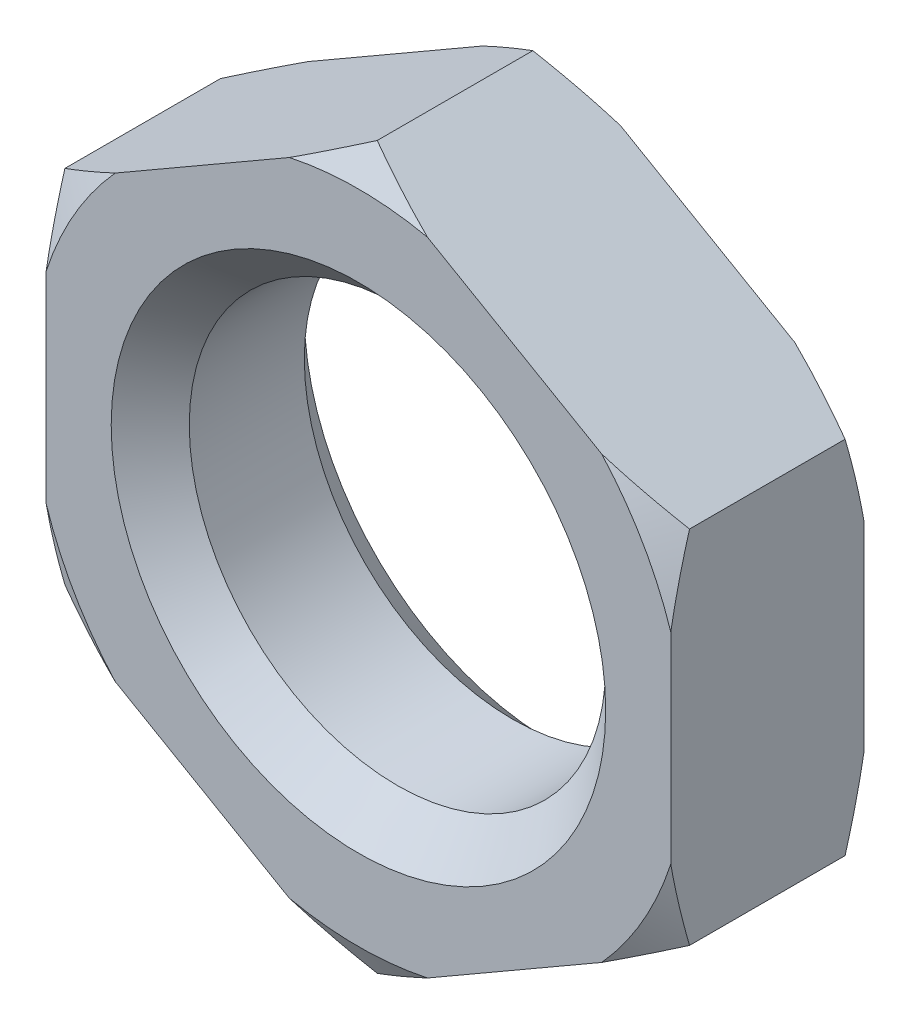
ISO-10303-21;
HEADER;
FILE_DESCRIPTION(('STEP AP214'),'2;1');
FILE_NAME('part.step','',(''),(''),'','','');
FILE_SCHEMA(('AUTOMOTIVE_DESIGN { 1 0 10303 214 1 1 1 1 }'));
ENDSEC;
DATA;
#1=APPLICATION_CONTEXT('core data for automotive mechanical design processes');
#2=APPLICATION_PROTOCOL_DEFINITION('international standard','automotive_design',2000,#1);
#3=PRODUCT_CONTEXT('',#1,'mechanical');
#4=PRODUCT('Part','Part','',(#3));
#5=PRODUCT_RELATED_PRODUCT_CATEGORY('part','',(#4));
#6=PRODUCT_DEFINITION_FORMATION('','',#4);
#7=PRODUCT_DEFINITION_CONTEXT('part definition',#1,'design');
#8=PRODUCT_DEFINITION('design','',#6,#7);
#9=PRODUCT_DEFINITION_SHAPE('','',#8);
#10=(LENGTH_UNIT() NAMED_UNIT(*) SI_UNIT(.MILLI.,.METRE.));
#11=(NAMED_UNIT(*) PLANE_ANGLE_UNIT() SI_UNIT($,.RADIAN.));
#12=(NAMED_UNIT(*) SI_UNIT($,.STERADIAN.) SOLID_ANGLE_UNIT());
#13=UNCERTAINTY_MEASURE_WITH_UNIT(LENGTH_MEASURE(1.E-05),#10,'distance_accuracy_value','');
#14=(GEOMETRIC_REPRESENTATION_CONTEXT(3) GLOBAL_UNCERTAINTY_ASSIGNED_CONTEXT((#13)) GLOBAL_UNIT_ASSIGNED_CONTEXT((#10,
#11,#12)) REPRESENTATION_CONTEXT('',''));
#15=CARTESIAN_POINT('',(0.,0.,0.));
#16=DIRECTION('',(0.,0.,1.));
#17=DIRECTION('',(1.,0.,0.));
#18=AXIS2_PLACEMENT_3D('',#15,#16,#17);
#19=CARTESIAN_POINT('',(0.,0.,-3.71));
#20=DIRECTION('',(0.,0.,1.));
#21=DIRECTION('',(1.,0.,0.));
#22=AXIS2_PLACEMENT_3D('',#19,#20,#21);
#23=PLANE('',#22);
#24=CARTESIAN_POINT('',(0.,0.,-3.71));
#25=DIRECTION('',(0.,0.,1.));
#26=DIRECTION('',(1.,0.,0.));
#27=AXIS2_PLACEMENT_3D('',#24,#25,#26);
#28=CIRCLE('',#27,9.49999999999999);
#29=CARTESIAN_POINT('',(-9.49999999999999,0.,-3.71));
#30=VERTEX_POINT('',#29);
#31=EDGE_CURVE('E428',#30,#30,#28,.T.);
#32=ORIENTED_EDGE('',*,*,#31,.T.);
#33=EDGE_LOOP('',(#32));
#34=FACE_BOUND('',#33,.T.);
#35=DIRECTION('',(0.,1.,0.));
#36=VECTOR('',#35,1.);
#37=CARTESIAN_POINT('',(12.,-6.92820323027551,-3.71));
#38=LINE('',#37,#36);
#39=CARTESIAN_POINT('',(12.,-3.86283365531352,-3.71));
#40=VERTEX_POINT('',#39);
#41=CARTESIAN_POINT('',(12.,3.86283365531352,-3.71));
#42=VERTEX_POINT('',#41);
#43=EDGE_CURVE('E365',#40,#42,#38,.T.);
#44=ORIENTED_EDGE('',*,*,#43,.F.);
#45=CARTESIAN_POINT('',(0.,0.,-3.71));
#46=DIRECTION('',(0.,0.,-1.));
#47=DIRECTION('',(-1.,0.,0.));
#48=AXIS2_PLACEMENT_3D('',#45,#46,#47);
#49=CIRCLE('',#48,12.606406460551);
#50=CARTESIAN_POINT('',(9.345312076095,-8.46088801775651,-3.71));
#51=VERTEX_POINT('',#50);
#52=EDGE_CURVE('E353',#40,#51,#49,.T.);
#53=ORIENTED_EDGE('',*,*,#52,.T.);
#54=DIRECTION('',(0.866025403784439,0.5,0.));
#55=VECTOR('',#54,1.);
#56=CARTESIAN_POINT('',(0.,-13.856406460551,-3.71));
#57=LINE('',#56,#55);
#58=CARTESIAN_POINT('',(2.65468792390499,-12.32372167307,-3.71));
#59=VERTEX_POINT('',#58);
#60=EDGE_CURVE('E375',#59,#51,#57,.T.);
#61=ORIENTED_EDGE('',*,*,#60,.F.);
#62=CARTESIAN_POINT('',(-2.65468792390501,-12.32372167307,-3.71));
#63=VERTEX_POINT('',#62);
#64=EDGE_CURVE('E349',#59,#63,#49,.T.);
#65=ORIENTED_EDGE('',*,*,#64,.T.);
#66=DIRECTION('',(0.866025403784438,-0.5,0.));
#67=VECTOR('',#66,1.);
#68=CARTESIAN_POINT('',(-12.,-6.9282032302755,-3.71));
#69=LINE('',#68,#67);
#70=CARTESIAN_POINT('',(-9.345312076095,-8.46088801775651,-3.71));
#71=VERTEX_POINT('',#70);
#72=EDGE_CURVE('E381',#71,#63,#69,.T.);
#73=ORIENTED_EDGE('',*,*,#72,.F.);
#74=CARTESIAN_POINT('',(-12.,-3.86283365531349,-3.71));
#75=VERTEX_POINT('',#74);
#76=EDGE_CURVE('E341',#71,#75,#49,.T.);
#77=ORIENTED_EDGE('',*,*,#76,.T.);
#78=DIRECTION('',(0.,-1.,0.));
#79=VECTOR('',#78,1.);
#80=CARTESIAN_POINT('',(-12.,6.92820323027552,-3.71));
#81=LINE('',#80,#79);
#82=CARTESIAN_POINT('',(-12.,3.86283365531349,-3.71));
#83=VERTEX_POINT('',#82);
#84=EDGE_CURVE('E477',#83,#75,#81,.T.);
#85=ORIENTED_EDGE('',*,*,#84,.F.);
#86=CARTESIAN_POINT('',(-9.34531207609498,8.46088801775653,-3.71));
#87=VERTEX_POINT('',#86);
#88=EDGE_CURVE('E63',#83,#87,#49,.T.);
#89=ORIENTED_EDGE('',*,*,#88,.T.);
#90=DIRECTION('',(-0.866025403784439,-0.5,0.));
#91=VECTOR('',#90,1.);
#92=CARTESIAN_POINT('',(0.,13.856406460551,-3.71));
#93=LINE('',#92,#91);
#94=CARTESIAN_POINT('',(-2.65468792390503,12.32372167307,-3.71));
#95=VERTEX_POINT('',#94);
#96=EDGE_CURVE('E181',#95,#87,#93,.T.);
#97=ORIENTED_EDGE('',*,*,#96,.F.);
#98=CARTESIAN_POINT('',(2.65468792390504,12.32372167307,-3.71));
#99=VERTEX_POINT('',#98);
#100=EDGE_CURVE('E55',#95,#99,#49,.T.);
#101=ORIENTED_EDGE('',*,*,#100,.T.);
#102=DIRECTION('',(-0.866025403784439,0.5,0.));
#103=VECTOR('',#102,1.);
#104=CARTESIAN_POINT('',(12.,6.92820323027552,-3.71));
#105=LINE('',#104,#103);
#106=CARTESIAN_POINT('',(9.34531207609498,8.46088801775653,-3.71));
#107=VERTEX_POINT('',#106);
#108=EDGE_CURVE('E366',#107,#99,#105,.T.);
#109=ORIENTED_EDGE('',*,*,#108,.F.);
#110=EDGE_CURVE('E346',#107,#42,#49,.T.);
#111=ORIENTED_EDGE('',*,*,#110,.T.);
#112=EDGE_LOOP('',(#44,#53,#61,#65,#73,#77,#85,#89,#97,#101,#109,#111));
#113=FACE_BOUND('',#112,.T.);
#114=ADVANCED_FACE('F39',(#34,#113),#23,.F.);
#115=CARTESIAN_POINT('',(0.,0.,3.71));
#116=DIRECTION('',(0.,0.,1.));
#117=DIRECTION('',(1.,0.,0.));
#118=AXIS2_PLACEMENT_3D('',#115,#116,#117);
#119=PLANE('',#118);
#120=CARTESIAN_POINT('',(0.,0.,3.71));
#121=DIRECTION('',(0.,0.,1.));
#122=DIRECTION('',(1.,0.,0.));
#123=AXIS2_PLACEMENT_3D('',#120,#121,#122);
#124=CIRCLE('',#123,9.50000000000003);
#125=CARTESIAN_POINT('',(9.50000000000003,0.,3.71));
#126=VERTEX_POINT('',#125);
#127=EDGE_CURVE('E11',#126,#126,#124,.F.);
#128=ORIENTED_EDGE('',*,*,#127,.T.);
#129=EDGE_LOOP('',(#128));
#130=FACE_BOUND('',#129,.T.);
#131=CARTESIAN_POINT('',(0.,0.,3.71));
#132=DIRECTION('',(0.,0.,-1.));
#133=DIRECTION('',(-1.,0.,0.));
#134=AXIS2_PLACEMENT_3D('',#131,#132,#133);
#135=CIRCLE('',#134,12.606406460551);
#136=CARTESIAN_POINT('',(12.,-3.86283365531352,3.71));
#137=VERTEX_POINT('',#136);
#138=CARTESIAN_POINT('',(9.345312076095,-8.46088801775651,3.71));
#139=VERTEX_POINT('',#138);
#140=EDGE_CURVE('E315',#137,#139,#135,.T.);
#141=ORIENTED_EDGE('',*,*,#140,.F.);
#142=DIRECTION('',(0.,1.,0.));
#143=VECTOR('',#142,1.);
#144=CARTESIAN_POINT('',(12.,-6.92820323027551,3.71));
#145=LINE('',#144,#143);
#146=CARTESIAN_POINT('',(12.,3.86283365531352,3.71));
#147=VERTEX_POINT('',#146);
#148=EDGE_CURVE('E388',#137,#147,#145,.T.);
#149=ORIENTED_EDGE('',*,*,#148,.T.);
#150=CARTESIAN_POINT('',(9.34531207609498,8.46088801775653,3.71));
#151=VERTEX_POINT('',#150);
#152=EDGE_CURVE('E307',#151,#147,#135,.T.);
#153=ORIENTED_EDGE('',*,*,#152,.F.);
#154=DIRECTION('',(-0.866025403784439,0.5,0.));
#155=VECTOR('',#154,1.);
#156=CARTESIAN_POINT('',(12.,6.92820323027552,3.71));
#157=LINE('',#156,#155);
#158=CARTESIAN_POINT('',(2.65468792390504,12.32372167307,3.71));
#159=VERTEX_POINT('',#158);
#160=EDGE_CURVE('E374',#151,#159,#157,.T.);
#161=ORIENTED_EDGE('',*,*,#160,.T.);
#162=CARTESIAN_POINT('',(-2.65468792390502,12.32372167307,3.71));
#163=VERTEX_POINT('',#162);
#164=EDGE_CURVE('E297',#163,#159,#135,.T.);
#165=ORIENTED_EDGE('',*,*,#164,.F.);
#166=DIRECTION('',(-0.866025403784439,-0.5,0.));
#167=VECTOR('',#166,1.);
#168=CARTESIAN_POINT('',(0.,13.856406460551,3.71));
#169=LINE('',#168,#167);
#170=CARTESIAN_POINT('',(-9.34531207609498,8.46088801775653,3.71));
#171=VERTEX_POINT('',#170);
#172=EDGE_CURVE('E379',#163,#171,#169,.T.);
#173=ORIENTED_EDGE('',*,*,#172,.T.);
#174=CARTESIAN_POINT('',(-12.,3.86283365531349,3.71));
#175=VERTEX_POINT('',#174);
#176=EDGE_CURVE('E295',#175,#171,#135,.T.);
#177=ORIENTED_EDGE('',*,*,#176,.F.);
#178=DIRECTION('',(0.,-1.,0.));
#179=VECTOR('',#178,1.);
#180=CARTESIAN_POINT('',(-12.,6.92820323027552,3.71));
#181=LINE('',#180,#179);
#182=CARTESIAN_POINT('',(-12.,-3.86283365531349,3.71));
#183=VERTEX_POINT('',#182);
#184=EDGE_CURVE('E486',#175,#183,#181,.T.);
#185=ORIENTED_EDGE('',*,*,#184,.T.);
#186=CARTESIAN_POINT('',(-9.345312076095,-8.46088801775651,3.71));
#187=VERTEX_POINT('',#186);
#188=EDGE_CURVE('E298',#187,#183,#135,.T.);
#189=ORIENTED_EDGE('',*,*,#188,.F.);
#190=DIRECTION('',(0.866025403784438,-0.5,0.));
#191=VECTOR('',#190,1.);
#192=CARTESIAN_POINT('',(-12.,-6.9282032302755,3.71));
#193=LINE('',#192,#191);
#194=CARTESIAN_POINT('',(-2.65468792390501,-12.32372167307,3.71));
#195=VERTEX_POINT('',#194);
#196=EDGE_CURVE('E468',#187,#195,#193,.T.);
#197=ORIENTED_EDGE('',*,*,#196,.T.);
#198=CARTESIAN_POINT('',(2.65468792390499,-12.32372167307,3.71));
#199=VERTEX_POINT('',#198);
#200=EDGE_CURVE('E309',#199,#195,#135,.T.);
#201=ORIENTED_EDGE('',*,*,#200,.F.);
#202=DIRECTION('',(0.866025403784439,0.5,0.));
#203=VECTOR('',#202,1.);
#204=CARTESIAN_POINT('',(0.,-13.856406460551,3.71));
#205=LINE('',#204,#203);
#206=EDGE_CURVE('E466',#199,#139,#205,.T.);
#207=ORIENTED_EDGE('',*,*,#206,.T.);
#208=EDGE_LOOP('',(#141,#149,#153,#161,#165,#173,#177,#185,#189,#197,#201,#207));
#209=FACE_BOUND('',#208,.T.);
#210=ADVANCED_FACE('F419',(#130,#209),#119,.T.);
#211=CARTESIAN_POINT('',(12.,6.92820323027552,3.71));
#212=DIRECTION('',(-0.5,-0.866025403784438,0.));
#213=DIRECTION('',(0.866025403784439,-0.5,0.));
#214=AXIS2_PLACEMENT_3D('',#211,#212,#213);
#215=PLANE('',#214);
#216=DIRECTION('',(0.,0.,-1.));
#217=VECTOR('',#216,1.);
#218=CARTESIAN_POINT('',(12.,6.92820323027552,3.71));
#219=LINE('',#218,#217);
#220=CARTESIAN_POINT('',(12.,6.92820323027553,2.98831216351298));
#221=VERTEX_POINT('',#220);
#222=CARTESIAN_POINT('',(12.,6.92820323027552,-2.98831216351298));
#223=VERTEX_POINT('',#222);
#224=EDGE_CURVE('E385',#221,#223,#219,.T.);
#225=ORIENTED_EDGE('',*,*,#224,.T.);
#226=CARTESIAN_POINT('',(20.325312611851,2.12158175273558,0.810267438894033));
#227=CARTESIAN_POINT('',(19.9483251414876,2.33923557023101,0.606879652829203));
#228=CARTESIAN_POINT('',(19.5704348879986,2.55741060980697,0.40568874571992));
#229=CARTESIAN_POINT('',(18.812468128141,2.99502292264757,0.00873247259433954));
#230=CARTESIAN_POINT('',(18.4323913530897,3.21446035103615,-0.187032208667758));
#231=CARTESIAN_POINT('',(17.6685395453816,3.65547039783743,-0.5726715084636));
#232=CARTESIAN_POINT('',(17.2847565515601,3.87704761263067,-0.762525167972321));
#233=CARTESIAN_POINT('',(16.514313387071,4.32186318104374,-1.13426460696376));
#234=CARTESIAN_POINT('',(16.1276533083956,4.54510148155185,-1.31615063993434));
#235=CARTESIAN_POINT('',(15.3411450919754,4.99919221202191,-1.67470055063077));
#236=CARTESIAN_POINT('',(14.9412112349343,5.23009413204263,-1.85111488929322));
#237=CARTESIAN_POINT('',(14.1373076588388,5.69422807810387,-2.19136066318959));
#238=CARTESIAN_POINT('',(13.7333377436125,5.9274602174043,-2.3551914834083));
#239=CARTESIAN_POINT('',(12.9212693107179,6.39630814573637,-2.66714780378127));
#240=CARTESIAN_POINT('',(12.5131752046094,6.63192138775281,-2.81528846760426));
#241=CARTESIAN_POINT('',(11.6921957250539,7.10591411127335,-3.09244141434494));
#242=CARTESIAN_POINT('',(11.2793109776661,7.34429323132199,-3.22145616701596));
#243=CARTESIAN_POINT('',(10.2917951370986,7.91443576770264,-3.50049654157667));
#244=CARTESIAN_POINT('',(9.71486260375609,8.24752792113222,-3.64010956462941));
#245=CARTESIAN_POINT('',(8.84357287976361,8.75056727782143,-3.80783040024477));
#246=CARTESIAN_POINT('',(8.55217528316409,8.91880575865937,-3.85678621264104));
#247=CARTESIAN_POINT('',(7.96774912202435,9.25622436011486,-3.93957457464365));
#248=CARTESIAN_POINT('',(7.67472057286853,9.42540447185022,-3.97340726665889));
#249=CARTESIAN_POINT('',(7.09100076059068,9.76241526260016,-4.02467472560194));
#250=CARTESIAN_POINT('',(6.80032178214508,9.93023884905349,-4.04229504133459));
#251=CARTESIAN_POINT('',(6.21856453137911,10.2661165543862,-4.06128380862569));
#252=CARTESIAN_POINT('',(5.92748626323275,10.4341706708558,-4.06265242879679));
#253=CARTESIAN_POINT('',(5.34561745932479,10.7701127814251,-4.04909415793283));
#254=CARTESIAN_POINT('',(5.05482692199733,10.9380007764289,-4.03416735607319));
#255=CARTESIAN_POINT('',(4.47415041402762,11.2732545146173,-3.98846983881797));
#256=CARTESIAN_POINT('',(4.18426459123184,11.4406201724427,-3.95769665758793));
#257=CARTESIAN_POINT('',(3.49922109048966,11.8361302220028,-3.86703084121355));
#258=CARTESIAN_POINT('',(3.10470921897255,12.0639017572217,-3.80058205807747));
#259=CARTESIAN_POINT('',(2.31946666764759,12.5172617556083,-3.64268657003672));
#260=CARTESIAN_POINT('',(1.92873654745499,12.742849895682,-3.55123622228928));
#261=CARTESIAN_POINT('',(1.15110326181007,13.1918166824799,-3.34679021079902));
#262=CARTESIAN_POINT('',(0.764204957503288,13.4151925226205,-3.23377014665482));
#263=CARTESIAN_POINT('',(-0.00524634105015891,13.8594354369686,-2.98974497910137));
#264=CARTESIAN_POINT('',(-0.387799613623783,14.0803026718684,-2.85874103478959));
#265=CARTESIAN_POINT('',(-1.1533506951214,14.5222937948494,-2.58021266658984));
#266=CARTESIAN_POINT('',(-1.53629955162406,14.7433894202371,-2.43251009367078));
#267=CARTESIAN_POINT('',(-2.29814046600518,15.1832384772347,-2.12471903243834));
#268=CARTESIAN_POINT('',(-2.67703502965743,15.4019933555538,-1.96463876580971));
#269=CARTESIAN_POINT('',(-3.43134974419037,15.8374971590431,-1.6342986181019));
#270=CARTESIAN_POINT('',(-3.80677080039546,16.0542466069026,-1.4640414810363));
#271=CARTESIAN_POINT('',(-4.55471407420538,16.4860718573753,-1.11510229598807));
#272=CARTESIAN_POINT('',(-4.92723589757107,16.7011474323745,-0.936419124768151));
#273=CARTESIAN_POINT('',(-5.55417591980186,17.0631114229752,-0.628795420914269));
#274=CARTESIAN_POINT('',(-5.80926889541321,17.2103894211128,-0.501680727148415));
#275=CARTESIAN_POINT('',(-6.3183451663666,17.5043047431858,-0.24454861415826));
#276=CARTESIAN_POINT('',(-6.57232849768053,17.6509420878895,-0.114531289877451));
#277=CARTESIAN_POINT('',(-7.07664399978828,17.9421087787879,0.146690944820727));
#278=CARTESIAN_POINT('',(-7.32698655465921,18.0866441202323,0.277869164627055));
#279=CARTESIAN_POINT('',(-7.82678970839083,18.3752056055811,0.542461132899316));
#280=CARTESIAN_POINT('',(-8.07625029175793,18.5192317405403,0.675874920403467));
#281=CARTESIAN_POINT('',(-8.32531261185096,18.663027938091,0.810267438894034));
#282=B_SPLINE_CURVE_WITH_KNOTS('',3,(#226,#227,#228,#229,#230,#231,#232,#233,#234,#235,#236,
#237,#238,#239,#240,#241,#242,#243,#244,#245,#246,#247,#248,#249,#250,#251,#252,#253,#254,#255,
#256,#257,#258,#259,#260,#261,#262,#263,#264,#265,#266,#267,#268,#269,#270,#271,#272,#273,#274,
#275,#276,#277,#278,#279,#280,#281),.UNSPECIFIED.,.F.,.F.,(4,2,2,2,2,2,2,2,2,2,2,2,2,2,2,2,2,2,
2,2,2,2,2,2,2,2,2,4),(0.,1.44145015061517,2.88308138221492,4.32934725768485,5.77556708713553,
7.25847595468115,8.74145725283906,10.2229919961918,11.7043352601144,13.7440858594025,
14.763863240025,15.7836310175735,16.7915769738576,17.7995124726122,18.8074424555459,
19.8155293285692,21.1957855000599,22.5762428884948,23.9582712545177,25.3402105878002,
26.7386060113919,28.1360804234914,29.5331797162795,30.9304657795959,31.8928914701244,
32.8552857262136,33.8076027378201,34.759936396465),.UNSPECIFIED.);
#283=EDGE_CURVE('E319',#223,#107,#282,.T.);
#284=ORIENTED_EDGE('',*,*,#283,.T.);
#285=ORIENTED_EDGE('',*,*,#108,.T.);
#286=CARTESIAN_POINT('',(0.,13.856406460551,-2.98831216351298));
#287=VERTEX_POINT('',#286);
#288=EDGE_CURVE('E310',#99,#287,#282,.T.);
#289=ORIENTED_EDGE('',*,*,#288,.T.);
#290=DIRECTION('',(0.,0.,-1.));
#291=VECTOR('',#290,1.);
#292=CARTESIAN_POINT('',(0.,13.856406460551,3.71));
#293=LINE('',#292,#291);
#294=CARTESIAN_POINT('',(0.,13.856406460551,2.98831216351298));
#295=VERTEX_POINT('',#294);
#296=EDGE_CURVE('E190',#295,#287,#293,.T.);
#297=ORIENTED_EDGE('',*,*,#296,.F.);
#298=CARTESIAN_POINT('',(-8.32531261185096,18.663027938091,-0.810267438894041));
#299=CARTESIAN_POINT('',(-7.94832514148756,18.4453741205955,-0.60687965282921));
#300=CARTESIAN_POINT('',(-7.57043488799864,18.2271990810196,-0.405688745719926));
#301=CARTESIAN_POINT('',(-6.812468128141,17.789586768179,-0.00873247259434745));
#302=CARTESIAN_POINT('',(-6.43239135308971,17.5701493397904,0.187032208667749));
#303=CARTESIAN_POINT('',(-5.66853954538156,17.1291392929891,0.572671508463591));
#304=CARTESIAN_POINT('',(-5.28475655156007,16.9075620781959,0.762525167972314));
#305=CARTESIAN_POINT('',(-4.51431338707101,16.4627465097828,1.13426460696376));
#306=CARTESIAN_POINT('',(-4.12765330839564,16.2395082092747,1.31615063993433));
#307=CARTESIAN_POINT('',(-3.34114509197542,15.7854174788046,1.67470055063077));
#308=CARTESIAN_POINT('',(-2.94121123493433,15.5545155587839,1.85111488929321));
#309=CARTESIAN_POINT('',(-2.13730765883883,15.0903816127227,2.19136066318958));
#310=CARTESIAN_POINT('',(-1.7333377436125,14.8571494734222,2.35519148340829));
#311=CARTESIAN_POINT('',(-0.92126931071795,14.3883015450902,2.66714780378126));
#312=CARTESIAN_POINT('',(-0.513175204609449,14.1526883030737,2.81528846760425));
#313=CARTESIAN_POINT('',(0.307804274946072,13.6786955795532,3.09244141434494));
#314=CARTESIAN_POINT('',(0.72068902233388,13.4403164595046,3.22145616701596));
#315=CARTESIAN_POINT('',(1.70820486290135,12.8701739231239,3.50049654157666));
#316=CARTESIAN_POINT('',(2.28513739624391,12.5370817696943,3.6401095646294));
#317=CARTESIAN_POINT('',(3.15642712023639,12.0340424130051,3.80783040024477));
#318=CARTESIAN_POINT('',(3.44782471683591,11.8658039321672,3.85678621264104));
#319=CARTESIAN_POINT('',(4.03225087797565,11.5283853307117,3.93957457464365));
#320=CARTESIAN_POINT('',(4.32527942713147,11.3592052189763,3.97340726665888));
#321=CARTESIAN_POINT('',(4.90899923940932,11.0221944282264,4.02467472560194));
#322=CARTESIAN_POINT('',(5.19967821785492,10.8543708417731,4.04229504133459));
#323=CARTESIAN_POINT('',(5.78143546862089,10.5184931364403,4.06128380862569));
#324=CARTESIAN_POINT('',(6.07251373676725,10.3504390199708,4.06265242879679));
#325=CARTESIAN_POINT('',(6.65438254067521,10.0144969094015,4.04909415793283));
#326=CARTESIAN_POINT('',(6.94517307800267,9.84660891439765,4.03416735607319));
#327=CARTESIAN_POINT('',(7.52584958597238,9.51135517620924,3.98846983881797));
#328=CARTESIAN_POINT('',(7.81573540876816,9.34398951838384,3.95769665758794));
#329=CARTESIAN_POINT('',(8.50077890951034,8.94847946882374,3.86703084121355));
#330=CARTESIAN_POINT('',(8.89529078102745,8.72070793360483,3.80058205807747));
#331=CARTESIAN_POINT('',(9.6805333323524,8.26734793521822,3.64268657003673));
#332=CARTESIAN_POINT('',(10.071263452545,8.04175979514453,3.55123622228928));
#333=CARTESIAN_POINT('',(10.8488967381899,7.59279300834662,3.34679021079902));
#334=CARTESIAN_POINT('',(11.2357950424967,7.36941716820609,3.23377014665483));
#335=CARTESIAN_POINT('',(12.0052463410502,6.92517425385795,2.98974497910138));
#336=CARTESIAN_POINT('',(12.3877996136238,6.7043070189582,2.85874103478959));
#337=CARTESIAN_POINT('',(13.1533506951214,6.26231589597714,2.58021266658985));
#338=CARTESIAN_POINT('',(13.5362995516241,6.04122027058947,2.43251009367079));
#339=CARTESIAN_POINT('',(14.2981404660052,5.60137121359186,2.12471903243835));
#340=CARTESIAN_POINT('',(14.6770350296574,5.38261633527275,1.96463876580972));
#341=CARTESIAN_POINT('',(15.4313497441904,4.94711253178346,1.63429861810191));
#342=CARTESIAN_POINT('',(15.8067708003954,4.730363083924,1.46404148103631));
#343=CARTESIAN_POINT('',(16.5547140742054,4.29853783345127,1.11510229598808));
#344=CARTESIAN_POINT('',(16.9272358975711,4.08346225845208,0.936419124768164));
#345=CARTESIAN_POINT('',(17.5541759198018,3.72149826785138,0.628795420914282));
#346=CARTESIAN_POINT('',(17.8092688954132,3.57422026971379,0.501680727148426));
#347=CARTESIAN_POINT('',(18.3183451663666,3.2803049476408,0.24454861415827));
#348=CARTESIAN_POINT('',(18.5723284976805,3.13366760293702,0.114531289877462));
#349=CARTESIAN_POINT('',(19.0766439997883,2.84250091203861,-0.146690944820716));
#350=CARTESIAN_POINT('',(19.3269865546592,2.69796557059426,-0.277869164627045));
#351=CARTESIAN_POINT('',(19.8267897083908,2.40940408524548,-0.542461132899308));
#352=CARTESIAN_POINT('',(20.0762502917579,2.26537795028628,-0.675874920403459));
#353=CARTESIAN_POINT('',(20.325312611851,2.12158175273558,-0.810267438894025));
#354=B_SPLINE_CURVE_WITH_KNOTS('',3,(#298,#299,#300,#301,#302,#303,#304,#305,#306,#307,#308,
#309,#310,#311,#312,#313,#314,#315,#316,#317,#318,#319,#320,#321,#322,#323,#324,#325,#326,#327,
#328,#329,#330,#331,#332,#333,#334,#335,#336,#337,#338,#339,#340,#341,#342,#343,#344,#345,#346,
#347,#348,#349,#350,#351,#352,#353),.UNSPECIFIED.,.F.,.F.,(4,2,2,2,2,2,2,2,2,2,2,2,2,2,2,2,2,2,
2,2,2,2,2,2,2,2,2,4),(0.,1.44145015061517,2.88308138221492,4.32934725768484,5.77556708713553,
7.25847595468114,8.74145725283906,10.2229919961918,11.7043352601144,13.7440858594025,
14.763863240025,15.7836310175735,16.7915769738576,17.7995124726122,18.8074424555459,
19.8155293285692,21.1957855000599,22.5762428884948,23.9582712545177,25.3402105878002,
26.7386060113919,28.1360804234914,29.5331797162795,30.9304657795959,31.8928914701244,
32.8552857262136,33.8076027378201,34.759936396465),.UNSPECIFIED.);
#355=EDGE_CURVE('E474',#295,#159,#354,.T.);
#356=ORIENTED_EDGE('',*,*,#355,.T.);
#357=ORIENTED_EDGE('',*,*,#160,.F.);
#358=EDGE_CURVE('E248',#151,#221,#354,.T.);
#359=ORIENTED_EDGE('',*,*,#358,.T.);
#360=EDGE_LOOP('',(#225,#284,#285,#289,#297,#356,#357,#359));
#361=FACE_BOUND('',#360,.T.);
#362=ADVANCED_FACE('F424',(#361),#215,.F.);
#363=CARTESIAN_POINT('',(0.,13.856406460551,3.71));
#364=DIRECTION('',(0.5,-0.866025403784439,0.));
#365=DIRECTION('',(0.866025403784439,0.5,0.));
#366=AXIS2_PLACEMENT_3D('',#363,#364,#365);
#367=PLANE('',#366);
#368=ORIENTED_EDGE('',*,*,#296,.T.);
#369=CARTESIAN_POINT('',(8.32531261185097,18.663027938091,0.810267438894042));
#370=CARTESIAN_POINT('',(7.94832514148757,18.4453741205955,0.606879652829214));
#371=CARTESIAN_POINT('',(7.57043488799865,18.2271990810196,0.40568874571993));
#372=CARTESIAN_POINT('',(6.81246812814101,17.789586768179,0.0087324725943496));
#373=CARTESIAN_POINT('',(6.43239135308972,17.5701493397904,-0.187032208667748));
#374=CARTESIAN_POINT('',(5.66853954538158,17.1291392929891,-0.57267150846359));
#375=CARTESIAN_POINT('',(5.28475655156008,16.9075620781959,-0.76252516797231));
#376=CARTESIAN_POINT('',(4.51431338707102,16.4627465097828,-1.13426460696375));
#377=CARTESIAN_POINT('',(4.12765330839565,16.2395082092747,-1.31615063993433));
#378=CARTESIAN_POINT('',(3.34114509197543,15.7854174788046,-1.67470055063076));
#379=CARTESIAN_POINT('',(2.94121123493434,15.5545155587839,-1.85111488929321));
#380=CARTESIAN_POINT('',(2.13730765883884,15.0903816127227,-2.19136066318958));
#381=CARTESIAN_POINT('',(1.73333774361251,14.8571494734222,-2.35519148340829));
#382=CARTESIAN_POINT('',(0.921269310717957,14.3883015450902,-2.66714780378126));
#383=CARTESIAN_POINT('',(0.513175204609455,14.1526883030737,-2.81528846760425));
#384=CARTESIAN_POINT('',(-0.307804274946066,13.6786955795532,-3.09244141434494));
#385=CARTESIAN_POINT('',(-0.720689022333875,13.4403164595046,-3.22145616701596));
#386=CARTESIAN_POINT('',(-1.70820486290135,12.8701739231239,-3.50049654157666));
#387=CARTESIAN_POINT('',(-2.28513739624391,12.5370817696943,-3.6401095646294));
#388=CARTESIAN_POINT('',(-3.15642712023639,12.0340424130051,-3.80783040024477));
#389=CARTESIAN_POINT('',(-3.44782471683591,11.8658039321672,-3.85678621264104));
#390=CARTESIAN_POINT('',(-4.03225087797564,11.5283853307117,-3.93957457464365));
#391=CARTESIAN_POINT('',(-4.32527942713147,11.3592052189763,-3.97340726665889));
#392=CARTESIAN_POINT('',(-4.90899923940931,11.0221944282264,-4.02467472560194));
#393=CARTESIAN_POINT('',(-5.19967821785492,10.8543708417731,-4.04229504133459));
#394=CARTESIAN_POINT('',(-5.78143546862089,10.5184931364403,-4.06128380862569));
#395=CARTESIAN_POINT('',(-6.07251373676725,10.3504390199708,-4.06265242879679));
#396=CARTESIAN_POINT('',(-6.6543825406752,10.0144969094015,-4.04909415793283));
#397=CARTESIAN_POINT('',(-6.94517307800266,9.84660891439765,-4.03416735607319));
#398=CARTESIAN_POINT('',(-7.52584958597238,9.51135517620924,-3.98846983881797));
#399=CARTESIAN_POINT('',(-7.81573540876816,9.34398951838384,-3.95769665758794));
#400=CARTESIAN_POINT('',(-8.50077890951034,8.94847946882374,-3.86703084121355));
#401=CARTESIAN_POINT('',(-8.89529078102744,8.72070793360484,-3.80058205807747));
#402=CARTESIAN_POINT('',(-9.6805333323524,8.26734793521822,-3.64268657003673));
#403=CARTESIAN_POINT('',(-10.071263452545,8.04175979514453,-3.55123622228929));
#404=CARTESIAN_POINT('',(-10.8488967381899,7.59279300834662,-3.34679021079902));
#405=CARTESIAN_POINT('',(-11.2357950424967,7.36941716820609,-3.23377014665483));
#406=CARTESIAN_POINT('',(-12.0052463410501,6.92517425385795,-2.98974497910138));
#407=CARTESIAN_POINT('',(-12.3877996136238,6.7043070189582,-2.8587410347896));
#408=CARTESIAN_POINT('',(-13.1533506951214,6.26231589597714,-2.58021266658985));
#409=CARTESIAN_POINT('',(-13.536299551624,6.04122027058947,-2.43251009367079));
#410=CARTESIAN_POINT('',(-14.2981404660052,5.60137121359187,-2.12471903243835));
#411=CARTESIAN_POINT('',(-14.6770350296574,5.38261633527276,-1.96463876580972));
#412=CARTESIAN_POINT('',(-15.4313497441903,4.94711253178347,-1.63429861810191));
#413=CARTESIAN_POINT('',(-15.8067708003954,4.73036308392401,-1.46404148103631));
#414=CARTESIAN_POINT('',(-16.5547140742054,4.29853783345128,-1.11510229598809));
#415=CARTESIAN_POINT('',(-16.927235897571,4.08346225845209,-0.936419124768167));
#416=CARTESIAN_POINT('',(-17.5541759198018,3.72149826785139,-0.628795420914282));
#417=CARTESIAN_POINT('',(-17.8092688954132,3.57422026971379,-0.501680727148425));
#418=CARTESIAN_POINT('',(-18.3183451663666,3.2803049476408,-0.244548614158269));
#419=CARTESIAN_POINT('',(-18.5723284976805,3.13366760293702,-0.114531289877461));
#420=CARTESIAN_POINT('',(-19.0766439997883,2.84250091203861,0.146690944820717));
#421=CARTESIAN_POINT('',(-19.3269865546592,2.69796557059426,0.277869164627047));
#422=CARTESIAN_POINT('',(-19.8267897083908,2.40940408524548,0.542461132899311));
#423=CARTESIAN_POINT('',(-20.0762502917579,2.26537795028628,0.675874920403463));
#424=CARTESIAN_POINT('',(-20.325312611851,2.12158175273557,0.810267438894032));
#425=B_SPLINE_CURVE_WITH_KNOTS('',3,(#369,#370,#371,#372,#373,#374,#375,#376,#377,#378,#379,
#380,#381,#382,#383,#384,#385,#386,#387,#388,#389,#390,#391,#392,#393,#394,#395,#396,#397,#398,
#399,#400,#401,#402,#403,#404,#405,#406,#407,#408,#409,#410,#411,#412,#413,#414,#415,#416,#417,
#418,#419,#420,#421,#422,#423,#424),.UNSPECIFIED.,.F.,.F.,(4,2,2,2,2,2,2,2,2,2,2,2,2,2,2,2,2,2,
2,2,2,2,2,2,2,2,2,4),(0.,1.44145015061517,2.88308138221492,4.32934725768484,5.77556708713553,
7.25847595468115,8.74145725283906,10.2229919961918,11.7043352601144,13.7440858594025,
14.763863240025,15.7836310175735,16.7915769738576,17.7995124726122,18.807442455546,
19.8155293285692,21.19578550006,22.5762428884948,23.9582712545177,25.3402105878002,
26.7386060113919,28.1360804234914,29.5331797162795,30.9304657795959,31.8928914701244,
32.8552857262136,33.8076027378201,34.759936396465),.UNSPECIFIED.);
#426=EDGE_CURVE('E183',#287,#95,#425,.T.);
#427=ORIENTED_EDGE('',*,*,#426,.T.);
#428=ORIENTED_EDGE('',*,*,#96,.T.);
#429=CARTESIAN_POINT('',(-12.,6.92820323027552,-2.98831216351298));
#430=VERTEX_POINT('',#429);
#431=EDGE_CURVE('E165',#87,#430,#425,.T.);
#432=ORIENTED_EDGE('',*,*,#431,.T.);
#433=DIRECTION('',(0.,0.,-1.));
#434=VECTOR('',#433,1.);
#435=CARTESIAN_POINT('',(-12.,6.92820323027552,3.71));
#436=LINE('',#435,#434);
#437=CARTESIAN_POINT('',(-12.,6.92820323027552,2.98831216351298));
#438=VERTEX_POINT('',#437);
#439=EDGE_CURVE('E179',#438,#430,#436,.T.);
#440=ORIENTED_EDGE('',*,*,#439,.F.);
#441=CARTESIAN_POINT('',(-20.325312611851,2.12158175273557,-0.81026743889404));
#442=CARTESIAN_POINT('',(-19.9483251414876,2.339235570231,-0.606879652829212));
#443=CARTESIAN_POINT('',(-19.5704348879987,2.55741060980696,-0.405688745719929));
#444=CARTESIAN_POINT('',(-18.812468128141,2.99502292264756,-0.00873247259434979));
#445=CARTESIAN_POINT('',(-18.4323913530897,3.21446035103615,0.187032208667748));
#446=CARTESIAN_POINT('',(-17.6685395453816,3.65547039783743,0.57267150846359));
#447=CARTESIAN_POINT('',(-17.2847565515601,3.87704761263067,0.762525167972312));
#448=CARTESIAN_POINT('',(-16.514313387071,4.32186318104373,1.13426460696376));
#449=CARTESIAN_POINT('',(-16.1276533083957,4.54510148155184,1.31615063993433));
#450=CARTESIAN_POINT('',(-15.3411450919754,4.99919221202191,1.67470055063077));
#451=CARTESIAN_POINT('',(-14.9412112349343,5.23009413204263,1.85111488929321));
#452=CARTESIAN_POINT('',(-14.1373076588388,5.69422807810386,2.19136066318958));
#453=CARTESIAN_POINT('',(-13.7333377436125,5.9274602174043,2.35519148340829));
#454=CARTESIAN_POINT('',(-12.921269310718,6.39630814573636,2.66714780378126));
#455=CARTESIAN_POINT('',(-12.5131752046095,6.63192138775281,2.81528846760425));
#456=CARTESIAN_POINT('',(-11.6921957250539,7.10591411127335,3.09244141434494));
#457=CARTESIAN_POINT('',(-11.2793109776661,7.34429323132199,3.22145616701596));
#458=CARTESIAN_POINT('',(-10.2917951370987,7.91443576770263,3.50049654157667));
#459=CARTESIAN_POINT('',(-9.7148626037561,8.24752792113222,3.6401095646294));
#460=CARTESIAN_POINT('',(-8.84357287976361,8.75056727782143,3.80783040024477));
#461=CARTESIAN_POINT('',(-8.55217528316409,8.91880575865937,3.85678621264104));
#462=CARTESIAN_POINT('',(-7.96774912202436,9.25622436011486,3.93957457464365));
#463=CARTESIAN_POINT('',(-7.67472057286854,9.42540447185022,3.97340726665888));
#464=CARTESIAN_POINT('',(-7.09100076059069,9.76241526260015,4.02467472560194));
#465=CARTESIAN_POINT('',(-6.80032178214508,9.93023884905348,4.04229504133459));
#466=CARTESIAN_POINT('',(-6.21856453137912,10.2661165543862,4.06128380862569));
#467=CARTESIAN_POINT('',(-5.92748626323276,10.4341706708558,4.06265242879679));
#468=CARTESIAN_POINT('',(-5.3456174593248,10.7701127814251,4.04909415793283));
#469=CARTESIAN_POINT('',(-5.05482692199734,10.9380007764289,4.03416735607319));
#470=CARTESIAN_POINT('',(-4.47415041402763,11.2732545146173,3.98846983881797));
#471=CARTESIAN_POINT('',(-4.18426459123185,11.4406201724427,3.95769665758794));
#472=CARTESIAN_POINT('',(-3.49922109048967,11.8361302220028,3.86703084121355));
#473=CARTESIAN_POINT('',(-3.10470921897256,12.0639017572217,3.80058205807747));
#474=CARTESIAN_POINT('',(-2.31946666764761,12.5172617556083,3.64268657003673));
#475=CARTESIAN_POINT('',(-1.92873654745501,12.742849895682,3.55123622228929));
#476=CARTESIAN_POINT('',(-1.15110326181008,13.1918166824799,3.34679021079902));
#477=CARTESIAN_POINT('',(-0.764204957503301,13.4151925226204,3.23377014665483));
#478=CARTESIAN_POINT('',(0.0052463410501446,13.8594354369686,2.98974497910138));
#479=CARTESIAN_POINT('',(0.387799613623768,14.0803026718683,2.85874103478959));
#480=CARTESIAN_POINT('',(1.15335069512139,14.5222937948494,2.58021266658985));
#481=CARTESIAN_POINT('',(1.53629955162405,14.7433894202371,2.43251009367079));
#482=CARTESIAN_POINT('',(2.29814046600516,15.1832384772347,2.12471903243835));
#483=CARTESIAN_POINT('',(2.67703502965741,15.4019933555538,1.96463876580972));
#484=CARTESIAN_POINT('',(3.43134974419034,15.8374971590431,1.63429861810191));
#485=CARTESIAN_POINT('',(3.80677080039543,16.0542466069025,1.46404148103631));
#486=CARTESIAN_POINT('',(4.55471407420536,16.4860718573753,1.11510229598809));
#487=CARTESIAN_POINT('',(4.92723589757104,16.7011474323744,0.936419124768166));
#488=CARTESIAN_POINT('',(5.55417591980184,17.0631114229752,0.628795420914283));
#489=CARTESIAN_POINT('',(5.80926889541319,17.2103894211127,0.501680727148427));
#490=CARTESIAN_POINT('',(6.31834516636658,17.5043047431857,0.244548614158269));
#491=CARTESIAN_POINT('',(6.57232849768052,17.6509420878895,0.114531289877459));
#492=CARTESIAN_POINT('',(7.07664399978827,17.9421087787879,-0.146690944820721));
#493=CARTESIAN_POINT('',(7.3269865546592,18.0866441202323,-0.27786916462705));
#494=CARTESIAN_POINT('',(7.82678970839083,18.3752056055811,-0.542461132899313));
#495=CARTESIAN_POINT('',(8.07625029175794,18.5192317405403,-0.675874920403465));
#496=CARTESIAN_POINT('',(8.32531261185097,18.663027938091,-0.810267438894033));
#497=B_SPLINE_CURVE_WITH_KNOTS('',3,(#441,#442,#443,#444,#445,#446,#447,#448,#449,#450,#451,
#452,#453,#454,#455,#456,#457,#458,#459,#460,#461,#462,#463,#464,#465,#466,#467,#468,#469,#470,
#471,#472,#473,#474,#475,#476,#477,#478,#479,#480,#481,#482,#483,#484,#485,#486,#487,#488,#489,
#490,#491,#492,#493,#494,#495,#496),.UNSPECIFIED.,.F.,.F.,(4,2,2,2,2,2,2,2,2,2,2,2,2,2,2,2,2,2,
2,2,2,2,2,2,2,2,2,4),(0.,1.44145015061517,2.88308138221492,4.32934725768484,5.77556708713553,
7.25847595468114,8.74145725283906,10.2229919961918,11.7043352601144,13.7440858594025,
14.763863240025,15.7836310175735,16.7915769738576,17.7995124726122,18.8074424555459,
19.8155293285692,21.1957855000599,22.5762428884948,23.9582712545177,25.3402105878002,
26.7386060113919,28.1360804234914,29.5331797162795,30.9304657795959,31.8928914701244,
32.8552857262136,33.8076027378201,34.7599363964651),.UNSPECIFIED.);
#498=EDGE_CURVE('E268',#438,#171,#497,.T.);
#499=ORIENTED_EDGE('',*,*,#498,.T.);
#500=ORIENTED_EDGE('',*,*,#172,.F.);
#501=EDGE_CURVE('E480',#163,#295,#497,.T.);
#502=ORIENTED_EDGE('',*,*,#501,.T.);
#503=EDGE_LOOP('',(#368,#427,#428,#432,#440,#499,#500,#502));
#504=FACE_BOUND('',#503,.T.);
#505=ADVANCED_FACE('F177',(#504),#367,.F.);
#506=CARTESIAN_POINT('',(-12.,6.92820323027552,3.71));
#507=DIRECTION('',(1.,0.,0.));
#508=DIRECTION('',(0.,0.,-1.));
#509=AXIS2_PLACEMENT_3D('',#506,#507,#508);
#510=PLANE('',#509);
#511=ORIENTED_EDGE('',*,*,#439,.T.);
#512=CARTESIAN_POINT('',(-12.,15.2535158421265,0.21689117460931));
#513=CARTESIAN_POINT('',(-12.,14.8200186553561,0.0202387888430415));
#514=CARTESIAN_POINT('',(-12.,14.3853348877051,-0.173847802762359));
#515=CARTESIAN_POINT('',(-12.,13.5130859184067,-0.555644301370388));
#516=CARTESIAN_POINT('',(-12.,13.0755202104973,-0.743353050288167));
#517=CARTESIAN_POINT('',(-12.,12.1953183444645,-1.11184586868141));
#518=CARTESIAN_POINT('',(-12.,11.7526686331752,-1.29259768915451));
#519=CARTESIAN_POINT('',(-12.,10.8636251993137,-1.64462235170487));
#520=CARTESIAN_POINT('',(-12.,10.4172316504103,-1.81589563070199));
#521=CARTESIAN_POINT('',(-12.,9.52217191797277,-2.14610674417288));
#522=CARTESIAN_POINT('',(-12.,9.07352508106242,-2.30509675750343));
#523=CARTESIAN_POINT('',(-12.,8.17143438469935,-2.60900892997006));
#524=CARTESIAN_POINT('',(-12.,7.71799028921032,-2.75393039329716));
#525=CARTESIAN_POINT('',(-12.,6.80652206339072,-3.02638304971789));
#526=CARTESIAN_POINT('',(-12.,6.34850478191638,-3.15393698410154));
#527=CARTESIAN_POINT('',(-12.,5.4271714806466,-3.38823938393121));
#528=CARTESIAN_POINT('',(-12.,4.96385621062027,-3.49499075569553));
#529=CARTESIAN_POINT('',(-12.,4.16395759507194,-3.65708457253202));
#530=CARTESIAN_POINT('',(-12.,3.82858972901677,-3.71842784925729));
#531=CARTESIAN_POINT('',(-12.,3.15556467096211,-3.82699864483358));
#532=CARTESIAN_POINT('',(-12.,2.81790755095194,-3.87422660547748));
#533=CARTESIAN_POINT('',(-12.,2.14087054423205,-3.95331671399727));
#534=CARTESIAN_POINT('',(-12.,1.80149111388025,-3.98518273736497));
#535=CARTESIAN_POINT('',(-12.,1.12158602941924,-4.03264054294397));
#536=CARTESIAN_POINT('',(-12.,0.781060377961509,-4.04823236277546));
#537=CARTESIAN_POINT('',(-12.,0.0998225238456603,-4.06265536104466));
#538=CARTESIAN_POINT('',(-12.,-0.240889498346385,-4.06149498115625));
#539=CARTESIAN_POINT('',(-12.,-0.921840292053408,-4.04247109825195));
#540=CARTESIAN_POINT('',(-12.,-1.26207906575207,-4.02460767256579));
#541=CARTESIAN_POINT('',(-12.,-1.94134891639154,-3.97272302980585));
#542=CARTESIAN_POINT('',(-12.,-2.28037986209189,-3.9387001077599));
#543=CARTESIAN_POINT('',(-12.,-2.95656399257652,-3.85547519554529));
#544=CARTESIAN_POINT('',(-12.,-3.29371709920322,-3.80627257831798));
#545=CARTESIAN_POINT('',(-12.,-4.1328913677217,-3.66599641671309));
#546=CARTESIAN_POINT('',(-12.,-4.63347280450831,-3.56627062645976));
#547=CARTESIAN_POINT('',(-12.,-5.62863786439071,-3.34039555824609));
#548=CARTESIAN_POINT('',(-12.,-6.12322013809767,-3.21424044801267));
#549=CARTESIAN_POINT('',(-12.,-7.10736327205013,-2.93994900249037));
#550=CARTESIAN_POINT('',(-12.,-7.59691071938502,-2.79176500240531));
#551=CARTESIAN_POINT('',(-12.,-8.57024358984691,-2.47780613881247));
#552=CARTESIAN_POINT('',(-12.,-9.05402941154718,-2.31203250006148));
#553=CARTESIAN_POINT('',(-12.,-10.0219571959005,-1.96437293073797));
#554=CARTESIAN_POINT('',(-12.,-10.5060407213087,-1.78232529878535));
#555=CARTESIAN_POINT('',(-12.,-11.4696858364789,-1.40660307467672));
#556=CARTESIAN_POINT('',(-12.,-11.9492471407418,-1.2129277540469));
#557=CARTESIAN_POINT('',(-12.,-12.9015129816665,-0.817433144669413));
#558=CARTESIAN_POINT('',(-12.,-13.3742415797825,-0.615671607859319));
#559=CARTESIAN_POINT('',(-12.,-14.0808032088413,-0.307405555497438));
#560=CARTESIAN_POINT('',(-12.,-14.3158749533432,-0.203725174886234));
#561=CARTESIAN_POINT('',(-12.,-14.7852527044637,0.00534405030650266));
#562=CARTESIAN_POINT('',(-12.,-15.019558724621,0.11073286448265));
#563=CARTESIAN_POINT('',(-12.,-15.2535158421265,0.216891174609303));
#564=B_SPLINE_CURVE_WITH_KNOTS('',3,(#512,#513,#514,#515,#516,#517,#518,#519,#520,#521,#522,
#523,#524,#525,#526,#527,#528,#529,#530,#531,#532,#533,#534,#535,#536,#537,#538,#539,#540,#541,
#542,#543,#544,#545,#546,#547,#548,#549,#550,#551,#552,#553,#554,#555,#556,#557,#558,#559,#560,
#561,#562,#563),.UNSPECIFIED.,.F.,.F.,(4,2,2,2,2,2,2,2,2,2,2,2,2,2,2,2,2,2,2,2,2,2,2,2,2,4),(0.,
1.42807274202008,2.85640342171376,4.29070857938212,5.72494756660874,7.15271418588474,
8.58055138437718,10.0065005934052,11.4322504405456,12.4547851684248,13.4772878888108,
14.4995325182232,15.5217747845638,16.5435019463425,17.5652243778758,18.5870546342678,
19.6089271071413,21.139265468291,22.6699418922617,24.2039798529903,25.7379110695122,
27.2892750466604,28.8407363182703,30.3826058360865,31.1533631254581,31.9241067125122),.UNSPECIFIED.);
#565=EDGE_CURVE('E162',#430,#83,#564,.T.);
#566=ORIENTED_EDGE('',*,*,#565,.T.);
#567=ORIENTED_EDGE('',*,*,#84,.T.);
#568=CARTESIAN_POINT('',(-12.,-6.9282032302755,-2.98831216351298));
#569=VERTEX_POINT('',#568);
#570=EDGE_CURVE('E171',#75,#569,#564,.T.);
#571=ORIENTED_EDGE('',*,*,#570,.T.);
#572=DIRECTION('',(0.,0.,-1.));
#573=VECTOR('',#572,1.);
#574=CARTESIAN_POINT('',(-12.,-6.9282032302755,3.71));
#575=LINE('',#574,#573);
#576=CARTESIAN_POINT('',(-12.,-6.9282032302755,2.98831216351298));
#577=VERTEX_POINT('',#576);
#578=EDGE_CURVE('E191',#577,#569,#575,.T.);
#579=ORIENTED_EDGE('',*,*,#578,.F.);
#580=CARTESIAN_POINT('',(-12.,-15.2535158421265,-0.216891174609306));
#581=CARTESIAN_POINT('',(-12.,-14.8200186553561,-0.0202387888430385));
#582=CARTESIAN_POINT('',(-12.,-14.3853348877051,0.173847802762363));
#583=CARTESIAN_POINT('',(-12.,-13.5130859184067,0.555644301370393));
#584=CARTESIAN_POINT('',(-12.,-13.0755202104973,0.743353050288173));
#585=CARTESIAN_POINT('',(-12.,-12.1953183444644,1.11184586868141));
#586=CARTESIAN_POINT('',(-12.,-11.7526686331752,1.29259768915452));
#587=CARTESIAN_POINT('',(-12.,-10.8636251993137,1.64462235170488));
#588=CARTESIAN_POINT('',(-12.,-10.4172316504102,1.81589563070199));
#589=CARTESIAN_POINT('',(-12.,-9.52217191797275,2.14610674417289));
#590=CARTESIAN_POINT('',(-12.,-9.0735250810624,2.30509675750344));
#591=CARTESIAN_POINT('',(-12.,-8.17143438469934,2.60900892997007));
#592=CARTESIAN_POINT('',(-12.,-7.7179902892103,2.75393039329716));
#593=CARTESIAN_POINT('',(-12.,-6.8065220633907,3.02638304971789));
#594=CARTESIAN_POINT('',(-12.,-6.34850478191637,3.15393698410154));
#595=CARTESIAN_POINT('',(-12.,-5.42717148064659,3.38823938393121));
#596=CARTESIAN_POINT('',(-12.,-4.96385621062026,3.49499075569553));
#597=CARTESIAN_POINT('',(-12.,-4.16395759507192,3.65708457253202));
#598=CARTESIAN_POINT('',(-12.,-3.82858972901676,3.71842784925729));
#599=CARTESIAN_POINT('',(-12.,-3.15556467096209,3.82699864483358));
#600=CARTESIAN_POINT('',(-12.,-2.81790755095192,3.87422660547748));
#601=CARTESIAN_POINT('',(-12.,-2.14087054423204,3.95331671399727));
#602=CARTESIAN_POINT('',(-12.,-1.80149111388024,3.98518273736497));
#603=CARTESIAN_POINT('',(-12.,-1.12158602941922,4.03264054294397));
#604=CARTESIAN_POINT('',(-12.,-0.781060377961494,4.04823236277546));
#605=CARTESIAN_POINT('',(-12.,-0.0998225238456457,4.06265536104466));
#606=CARTESIAN_POINT('',(-12.,0.2408894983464,4.06149498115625));
#607=CARTESIAN_POINT('',(-12.,0.921840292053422,4.04247109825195));
#608=CARTESIAN_POINT('',(-12.,1.26207906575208,4.02460767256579));
#609=CARTESIAN_POINT('',(-12.,1.94134891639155,3.97272302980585));
#610=CARTESIAN_POINT('',(-12.,2.28037986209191,3.9387001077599));
#611=CARTESIAN_POINT('',(-12.,2.95656399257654,3.85547519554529));
#612=CARTESIAN_POINT('',(-12.,3.29371709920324,3.80627257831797));
#613=CARTESIAN_POINT('',(-12.,4.13289136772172,3.66599641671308));
#614=CARTESIAN_POINT('',(-12.,4.63347280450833,3.56627062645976));
#615=CARTESIAN_POINT('',(-12.,5.62863786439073,3.34039555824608));
#616=CARTESIAN_POINT('',(-12.,6.12322013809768,3.21424044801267));
#617=CARTESIAN_POINT('',(-12.,7.10736327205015,2.93994900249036));
#618=CARTESIAN_POINT('',(-12.,7.59691071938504,2.79176500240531));
#619=CARTESIAN_POINT('',(-12.,8.57024358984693,2.47780613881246));
#620=CARTESIAN_POINT('',(-12.,9.0540294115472,2.31203250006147));
#621=CARTESIAN_POINT('',(-12.,10.0219571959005,1.96437293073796));
#622=CARTESIAN_POINT('',(-12.,10.5060407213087,1.78232529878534));
#623=CARTESIAN_POINT('',(-12.,11.469685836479,1.40660307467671));
#624=CARTESIAN_POINT('',(-12.,11.9492471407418,1.21292775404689));
#625=CARTESIAN_POINT('',(-12.,12.9015129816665,0.817433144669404));
#626=CARTESIAN_POINT('',(-12.,13.3742415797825,0.61567160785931));
#627=CARTESIAN_POINT('',(-12.,14.0808032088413,0.307405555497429));
#628=CARTESIAN_POINT('',(-12.,14.3158749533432,0.203725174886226));
#629=CARTESIAN_POINT('',(-12.,14.7852527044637,-0.00534405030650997));
#630=CARTESIAN_POINT('',(-12.,15.0195587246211,-0.110732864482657));
#631=CARTESIAN_POINT('',(-12.,15.2535158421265,-0.216891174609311));
#632=B_SPLINE_CURVE_WITH_KNOTS('',3,(#580,#581,#582,#583,#584,#585,#586,#587,#588,#589,#590,
#591,#592,#593,#594,#595,#596,#597,#598,#599,#600,#601,#602,#603,#604,#605,#606,#607,#608,#609,
#610,#611,#612,#613,#614,#615,#616,#617,#618,#619,#620,#621,#622,#623,#624,#625,#626,#627,#628,
#629,#630,#631),.UNSPECIFIED.,.F.,.F.,(4,2,2,2,2,2,2,2,2,2,2,2,2,2,2,2,2,2,2,2,2,2,2,2,2,4),(0.,
1.42807274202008,2.85640342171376,4.29070857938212,5.72494756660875,7.15271418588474,
8.58055138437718,10.0065005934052,11.4322504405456,12.4547851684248,13.4772878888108,
14.4995325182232,15.5217747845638,16.5435019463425,17.5652243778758,18.5870546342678,
19.6089271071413,21.139265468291,22.6699418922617,24.2039798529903,25.7379110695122,
27.2892750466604,28.8407363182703,30.3826058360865,31.1533631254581,31.9241067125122),.UNSPECIFIED.);
#633=EDGE_CURVE('E260',#577,#183,#632,.T.);
#634=ORIENTED_EDGE('',*,*,#633,.T.);
#635=ORIENTED_EDGE('',*,*,#184,.F.);
#636=EDGE_CURVE('E188',#175,#438,#632,.T.);
#637=ORIENTED_EDGE('',*,*,#636,.T.);
#638=EDGE_LOOP('',(#511,#566,#567,#571,#579,#634,#635,#637));
#639=FACE_BOUND('',#638,.T.);
#640=ADVANCED_FACE('F186',(#639),#510,.F.);
#641=CARTESIAN_POINT('',(-12.,-6.9282032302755,3.71));
#642=DIRECTION('',(0.5,0.866025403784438,0.));
#643=DIRECTION('',(-0.866025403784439,0.5,0.));
#644=AXIS2_PLACEMENT_3D('',#641,#642,#643);
#645=PLANE('',#644);
#646=ORIENTED_EDGE('',*,*,#578,.T.);
#647=CARTESIAN_POINT('',(-20.325312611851,-2.12158175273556,0.810267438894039));
#648=CARTESIAN_POINT('',(-19.9483251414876,-2.33923557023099,0.60687965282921));
#649=CARTESIAN_POINT('',(-19.5704348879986,-2.55741060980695,0.405688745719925));
#650=CARTESIAN_POINT('',(-18.812468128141,-2.99502292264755,0.0087324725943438));
#651=CARTESIAN_POINT('',(-18.4323913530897,-3.21446035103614,-0.187032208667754));
#652=CARTESIAN_POINT('',(-17.6685395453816,-3.65547039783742,-0.572671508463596));
#653=CARTESIAN_POINT('',(-17.2847565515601,-3.87704761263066,-0.762525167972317));
#654=CARTESIAN_POINT('',(-16.514313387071,-4.32186318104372,-1.13426460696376));
#655=CARTESIAN_POINT('',(-16.1276533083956,-4.54510148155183,-1.31615063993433));
#656=CARTESIAN_POINT('',(-15.3411450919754,-4.9991922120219,-1.67470055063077));
#657=CARTESIAN_POINT('',(-14.9412112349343,-5.23009413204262,-1.85111488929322));
#658=CARTESIAN_POINT('',(-14.1373076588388,-5.69422807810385,-2.19136066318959));
#659=CARTESIAN_POINT('',(-13.7333377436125,-5.92746021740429,-2.3551914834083));
#660=CARTESIAN_POINT('',(-12.921269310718,-6.39630814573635,-2.66714780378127));
#661=CARTESIAN_POINT('',(-12.5131752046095,-6.6319213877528,-2.81528846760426));
#662=CARTESIAN_POINT('',(-11.6921957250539,-7.10591411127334,-3.09244141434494));
#663=CARTESIAN_POINT('',(-11.2793109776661,-7.34429323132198,-3.22145616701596));
#664=CARTESIAN_POINT('',(-10.2917951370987,-7.91443576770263,-3.50049654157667));
#665=CARTESIAN_POINT('',(-9.71486260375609,-8.24752792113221,-3.64010956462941));
#666=CARTESIAN_POINT('',(-8.84357287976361,-8.75056727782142,-3.80783040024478));
#667=CARTESIAN_POINT('',(-8.55217528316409,-8.91880575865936,-3.85678621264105));
#668=CARTESIAN_POINT('',(-7.96774912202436,-9.25622436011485,-3.93957457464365));
#669=CARTESIAN_POINT('',(-7.67472057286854,-9.42540447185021,-3.97340726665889));
#670=CARTESIAN_POINT('',(-7.09100076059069,-9.76241526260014,-4.02467472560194));
#671=CARTESIAN_POINT('',(-6.80032178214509,-9.93023884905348,-4.04229504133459));
#672=CARTESIAN_POINT('',(-6.21856453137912,-10.2661165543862,-4.06128380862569));
#673=CARTESIAN_POINT('',(-5.92748626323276,-10.4341706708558,-4.0626524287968));
#674=CARTESIAN_POINT('',(-5.3456174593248,-10.7701127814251,-4.04909415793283));
#675=CARTESIAN_POINT('',(-5.05482692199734,-10.9380007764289,-4.03416735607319));
#676=CARTESIAN_POINT('',(-4.47415041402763,-11.2732545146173,-3.98846983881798));
#677=CARTESIAN_POINT('',(-4.18426459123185,-11.4406201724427,-3.95769665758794));
#678=CARTESIAN_POINT('',(-3.49922109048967,-11.8361302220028,-3.86703084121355));
#679=CARTESIAN_POINT('',(-3.10470921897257,-12.0639017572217,-3.80058205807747));
#680=CARTESIAN_POINT('',(-2.31946666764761,-12.5172617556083,-3.64268657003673));
#681=CARTESIAN_POINT('',(-1.92873654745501,-12.742849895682,-3.55123622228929));
#682=CARTESIAN_POINT('',(-1.15110326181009,-13.1918166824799,-3.34679021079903));
#683=CARTESIAN_POINT('',(-0.764204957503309,-13.4151925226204,-3.23377014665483));
#684=CARTESIAN_POINT('',(0.00524634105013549,-13.8594354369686,-2.98974497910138));
#685=CARTESIAN_POINT('',(0.387799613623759,-14.0803026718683,-2.8587410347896));
#686=CARTESIAN_POINT('',(1.15335069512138,-14.5222937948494,-2.58021266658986));
#687=CARTESIAN_POINT('',(1.53629955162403,-14.7433894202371,-2.4325100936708));
#688=CARTESIAN_POINT('',(2.29814046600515,-15.1832384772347,-2.12471903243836));
#689=CARTESIAN_POINT('',(2.67703502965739,-15.4019933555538,-1.96463876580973));
#690=CARTESIAN_POINT('',(3.43134974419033,-15.8374971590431,-1.63429861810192));
#691=CARTESIAN_POINT('',(3.80677080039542,-16.0542466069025,-1.46404148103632));
#692=CARTESIAN_POINT('',(4.55471407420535,-16.4860718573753,-1.1151022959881));
#693=CARTESIAN_POINT('',(4.92723589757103,-16.7011474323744,-0.936419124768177));
#694=CARTESIAN_POINT('',(5.55417591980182,-17.0631114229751,-0.628795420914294));
#695=CARTESIAN_POINT('',(5.80926889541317,-17.2103894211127,-0.501680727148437));
#696=CARTESIAN_POINT('',(6.31834516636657,-17.5043047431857,-0.244548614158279));
#697=CARTESIAN_POINT('',(6.57232849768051,-17.6509420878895,-0.114531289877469));
#698=CARTESIAN_POINT('',(7.07664399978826,-17.9421087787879,0.14669094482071));
#699=CARTESIAN_POINT('',(7.32698655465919,-18.0866441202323,0.277869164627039));
#700=CARTESIAN_POINT('',(7.82678970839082,-18.3752056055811,0.542461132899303));
#701=CARTESIAN_POINT('',(8.07625029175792,-18.5192317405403,0.675874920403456));
#702=CARTESIAN_POINT('',(8.32531261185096,-18.663027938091,0.810267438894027));
#703=B_SPLINE_CURVE_WITH_KNOTS('',3,(#647,#648,#649,#650,#651,#652,#653,#654,#655,#656,#657,
#658,#659,#660,#661,#662,#663,#664,#665,#666,#667,#668,#669,#670,#671,#672,#673,#674,#675,#676,
#677,#678,#679,#680,#681,#682,#683,#684,#685,#686,#687,#688,#689,#690,#691,#692,#693,#694,#695,
#696,#697,#698,#699,#700,#701,#702),.UNSPECIFIED.,.F.,.F.,(4,2,2,2,2,2,2,2,2,2,2,2,2,2,2,2,2,2,
2,2,2,2,2,2,2,2,2,4),(0.,1.44145015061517,2.88308138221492,4.32934725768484,5.77556708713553,
7.25847595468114,8.74145725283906,10.2229919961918,11.7043352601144,13.7440858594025,
14.763863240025,15.7836310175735,16.7915769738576,17.7995124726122,18.8074424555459,
19.8155293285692,21.1957855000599,22.5762428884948,23.9582712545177,25.3402105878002,
26.7386060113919,28.1360804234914,29.5331797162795,30.9304657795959,31.8928914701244,
32.8552857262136,33.8076027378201,34.7599363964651),.UNSPECIFIED.);
#704=EDGE_CURVE('E286',#569,#71,#703,.T.);
#705=ORIENTED_EDGE('',*,*,#704,.T.);
#706=ORIENTED_EDGE('',*,*,#72,.T.);
#707=CARTESIAN_POINT('',(0.,-13.856406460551,-2.98831216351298));
#708=VERTEX_POINT('',#707);
#709=EDGE_CURVE('E287',#63,#708,#703,.T.);
#710=ORIENTED_EDGE('',*,*,#709,.T.);
#711=DIRECTION('',(0.,0.,-1.));
#712=VECTOR('',#711,1.);
#713=CARTESIAN_POINT('',(0.,-13.856406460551,3.71));
#714=LINE('',#713,#712);
#715=CARTESIAN_POINT('',(0.,-13.856406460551,2.98831216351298));
#716=VERTEX_POINT('',#715);
#717=EDGE_CURVE('E200',#716,#708,#714,.T.);
#718=ORIENTED_EDGE('',*,*,#717,.F.);
#719=CARTESIAN_POINT('',(8.32531261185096,-18.663027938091,-0.810267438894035));
#720=CARTESIAN_POINT('',(7.94832514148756,-18.4453741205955,-0.606879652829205));
#721=CARTESIAN_POINT('',(7.57043488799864,-18.2271990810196,-0.405688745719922));
#722=CARTESIAN_POINT('',(6.812468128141,-17.789586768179,-0.00873247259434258));
#723=CARTESIAN_POINT('',(6.43239135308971,-17.5701493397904,0.187032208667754));
#724=CARTESIAN_POINT('',(5.66853954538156,-17.1291392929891,0.572671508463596));
#725=CARTESIAN_POINT('',(5.28475655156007,-16.9075620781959,0.762525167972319));
#726=CARTESIAN_POINT('',(4.51431338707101,-16.4627465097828,1.13426460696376));
#727=CARTESIAN_POINT('',(4.12765330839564,-16.2395082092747,1.31615063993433));
#728=CARTESIAN_POINT('',(3.34114509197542,-15.7854174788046,1.67470055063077));
#729=CARTESIAN_POINT('',(2.94121123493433,-15.5545155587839,1.85111488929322));
#730=CARTESIAN_POINT('',(2.13730765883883,-15.0903816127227,2.19136066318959));
#731=CARTESIAN_POINT('',(1.73333774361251,-14.8571494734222,2.3551914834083));
#732=CARTESIAN_POINT('',(0.921269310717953,-14.3883015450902,2.66714780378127));
#733=CARTESIAN_POINT('',(0.513175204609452,-14.1526883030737,2.81528846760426));
#734=CARTESIAN_POINT('',(-0.307804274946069,-13.6786955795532,3.09244141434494));
#735=CARTESIAN_POINT('',(-0.720689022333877,-13.4403164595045,3.22145616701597));
#736=CARTESIAN_POINT('',(-1.70820486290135,-12.8701739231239,3.50049654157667));
#737=CARTESIAN_POINT('',(-2.28513739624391,-12.5370817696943,3.64010956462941));
#738=CARTESIAN_POINT('',(-3.15642712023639,-12.0340424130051,3.80783040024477));
#739=CARTESIAN_POINT('',(-3.44782471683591,-11.8658039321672,3.85678621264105));
#740=CARTESIAN_POINT('',(-4.03225087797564,-11.5283853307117,3.93957457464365));
#741=CARTESIAN_POINT('',(-4.32527942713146,-11.3592052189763,3.97340726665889));
#742=CARTESIAN_POINT('',(-4.90899923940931,-11.0221944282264,4.02467472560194));
#743=CARTESIAN_POINT('',(-5.19967821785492,-10.854370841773,4.04229504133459));
#744=CARTESIAN_POINT('',(-5.78143546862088,-10.5184931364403,4.06128380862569));
#745=CARTESIAN_POINT('',(-6.07251373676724,-10.3504390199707,4.0626524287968));
#746=CARTESIAN_POINT('',(-6.6543825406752,-10.0144969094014,4.04909415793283));
#747=CARTESIAN_POINT('',(-6.94517307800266,-9.84660891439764,4.03416735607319));
#748=CARTESIAN_POINT('',(-7.52584958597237,-9.51135517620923,3.98846983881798));
#749=CARTESIAN_POINT('',(-7.81573540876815,-9.34398951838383,3.95769665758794));
#750=CARTESIAN_POINT('',(-8.50077890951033,-8.94847946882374,3.86703084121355));
#751=CARTESIAN_POINT('',(-8.89529078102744,-8.72070793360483,3.80058205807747));
#752=CARTESIAN_POINT('',(-9.68053333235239,-8.26734793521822,3.64268657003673));
#753=CARTESIAN_POINT('',(-10.071263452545,-8.04175979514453,3.55123622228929));
#754=CARTESIAN_POINT('',(-10.8488967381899,-7.59279300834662,3.34679021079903));
#755=CARTESIAN_POINT('',(-11.2357950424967,-7.36941716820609,3.23377014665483));
#756=CARTESIAN_POINT('',(-12.0052463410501,-6.92517425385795,2.98974497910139));
#757=CARTESIAN_POINT('',(-12.3877996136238,-6.7043070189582,2.8587410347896));
#758=CARTESIAN_POINT('',(-13.1533506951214,-6.26231589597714,2.58021266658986));
#759=CARTESIAN_POINT('',(-13.536299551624,-6.04122027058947,2.4325100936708));
#760=CARTESIAN_POINT('',(-14.2981404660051,-5.60137121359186,2.12471903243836));
#761=CARTESIAN_POINT('',(-14.6770350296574,-5.38261633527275,1.96463876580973));
#762=CARTESIAN_POINT('',(-15.4313497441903,-4.94711253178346,1.63429861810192));
#763=CARTESIAN_POINT('',(-15.8067708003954,-4.730363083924,1.46404148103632));
#764=CARTESIAN_POINT('',(-16.5547140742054,-4.29853783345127,1.1151022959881));
#765=CARTESIAN_POINT('',(-16.927235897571,-4.08346225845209,0.936419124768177));
#766=CARTESIAN_POINT('',(-17.5541759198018,-3.72149826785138,0.628795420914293));
#767=CARTESIAN_POINT('',(-17.8092688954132,-3.57422026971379,0.501680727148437));
#768=CARTESIAN_POINT('',(-18.3183451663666,-3.28030494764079,0.244548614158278));
#769=CARTESIAN_POINT('',(-18.5723284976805,-3.13366760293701,0.114531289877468));
#770=CARTESIAN_POINT('',(-19.0766439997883,-2.8425009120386,-0.146690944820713));
#771=CARTESIAN_POINT('',(-19.3269865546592,-2.69796557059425,-0.277869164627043));
#772=CARTESIAN_POINT('',(-19.8267897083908,-2.40940408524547,-0.54246113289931));
#773=CARTESIAN_POINT('',(-20.0762502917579,-2.26537795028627,-0.675874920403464));
#774=CARTESIAN_POINT('',(-20.325312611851,-2.12158175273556,-0.810267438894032));
#775=B_SPLINE_CURVE_WITH_KNOTS('',3,(#719,#720,#721,#722,#723,#724,#725,#726,#727,#728,#729,
#730,#731,#732,#733,#734,#735,#736,#737,#738,#739,#740,#741,#742,#743,#744,#745,#746,#747,#748,
#749,#750,#751,#752,#753,#754,#755,#756,#757,#758,#759,#760,#761,#762,#763,#764,#765,#766,#767,
#768,#769,#770,#771,#772,#773,#774),.UNSPECIFIED.,.F.,.F.,(4,2,2,2,2,2,2,2,2,2,2,2,2,2,2,2,2,2,
2,2,2,2,2,2,2,2,2,4),(0.,1.44145015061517,2.88308138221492,4.32934725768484,5.77556708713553,
7.25847595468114,8.74145725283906,10.2229919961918,11.7043352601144,13.7440858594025,
14.763863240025,15.7836310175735,16.7915769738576,17.7995124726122,18.8074424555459,
19.8155293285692,21.1957855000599,22.5762428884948,23.9582712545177,25.3402105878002,
26.7386060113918,28.1360804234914,29.5331797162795,30.9304657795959,31.8928914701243,
32.8552857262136,33.8076027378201,34.759936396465),.UNSPECIFIED.);
#776=EDGE_CURVE('E254',#716,#195,#775,.T.);
#777=ORIENTED_EDGE('',*,*,#776,.T.);
#778=ORIENTED_EDGE('',*,*,#196,.F.);
#779=EDGE_CURVE('E267',#187,#577,#775,.T.);
#780=ORIENTED_EDGE('',*,*,#779,.T.);
#781=EDGE_LOOP('',(#646,#705,#706,#710,#718,#777,#778,#780));
#782=FACE_BOUND('',#781,.T.);
#783=ADVANCED_FACE('F276',(#782),#645,.F.);
#784=CARTESIAN_POINT('',(0.,-13.856406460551,3.71));
#785=DIRECTION('',(-0.5,0.866025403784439,0.));
#786=DIRECTION('',(-0.866025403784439,-0.5,0.));
#787=AXIS2_PLACEMENT_3D('',#784,#785,#786);
#788=PLANE('',#787);
#789=ORIENTED_EDGE('',*,*,#717,.T.);
#790=CARTESIAN_POINT('',(-8.32531261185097,-18.663027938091,0.810267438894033));
#791=CARTESIAN_POINT('',(-7.94832514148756,-18.4453741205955,0.606879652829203));
#792=CARTESIAN_POINT('',(-7.57043488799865,-18.2271990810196,0.40568874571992));
#793=CARTESIAN_POINT('',(-6.812468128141,-17.789586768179,0.00873247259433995));
#794=CARTESIAN_POINT('',(-6.43239135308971,-17.5701493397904,-0.187032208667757));
#795=CARTESIAN_POINT('',(-5.66853954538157,-17.1291392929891,-0.572671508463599));
#796=CARTESIAN_POINT('',(-5.28475655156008,-16.9075620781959,-0.762525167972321));
#797=CARTESIAN_POINT('',(-4.51431338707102,-16.4627465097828,-1.13426460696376));
#798=CARTESIAN_POINT('',(-4.12765330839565,-16.2395082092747,-1.31615063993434));
#799=CARTESIAN_POINT('',(-3.34114509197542,-15.7854174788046,-1.67470055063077));
#800=CARTESIAN_POINT('',(-2.94121123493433,-15.5545155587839,-1.85111488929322));
#801=CARTESIAN_POINT('',(-2.13730765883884,-15.0903816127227,-2.19136066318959));
#802=CARTESIAN_POINT('',(-1.73333774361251,-14.8571494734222,-2.3551914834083));
#803=CARTESIAN_POINT('',(-0.921269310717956,-14.3883015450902,-2.66714780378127));
#804=CARTESIAN_POINT('',(-0.513175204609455,-14.1526883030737,-2.81528846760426));
#805=CARTESIAN_POINT('',(0.307804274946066,-13.6786955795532,-3.09244141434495));
#806=CARTESIAN_POINT('',(0.720689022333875,-13.4403164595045,-3.22145616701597));
#807=CARTESIAN_POINT('',(1.70820486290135,-12.8701739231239,-3.50049654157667));
#808=CARTESIAN_POINT('',(2.28513739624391,-12.5370817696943,-3.64010956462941));
#809=CARTESIAN_POINT('',(3.15642712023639,-12.0340424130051,-3.80783040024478));
#810=CARTESIAN_POINT('',(3.44782471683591,-11.8658039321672,-3.85678621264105));
#811=CARTESIAN_POINT('',(4.03225087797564,-11.5283853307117,-3.93957457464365));
#812=CARTESIAN_POINT('',(4.32527942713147,-11.3592052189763,-3.97340726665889));
#813=CARTESIAN_POINT('',(4.90899923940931,-11.0221944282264,-4.02467472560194));
#814=CARTESIAN_POINT('',(5.19967821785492,-10.854370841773,-4.04229504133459));
#815=CARTESIAN_POINT('',(5.78143546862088,-10.5184931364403,-4.0612838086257));
#816=CARTESIAN_POINT('',(6.07251373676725,-10.3504390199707,-4.0626524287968));
#817=CARTESIAN_POINT('',(6.6543825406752,-10.0144969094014,-4.04909415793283));
#818=CARTESIAN_POINT('',(6.94517307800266,-9.84660891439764,-4.03416735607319));
#819=CARTESIAN_POINT('',(7.52584958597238,-9.51135517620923,-3.98846983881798));
#820=CARTESIAN_POINT('',(7.81573540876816,-9.34398951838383,-3.95769665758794));
#821=CARTESIAN_POINT('',(8.50077890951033,-8.94847946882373,-3.86703084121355));
#822=CARTESIAN_POINT('',(8.89529078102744,-8.72070793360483,-3.80058205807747));
#823=CARTESIAN_POINT('',(9.6805333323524,-8.26734793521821,-3.64268657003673));
#824=CARTESIAN_POINT('',(10.071263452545,-8.04175979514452,-3.55123622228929));
#825=CARTESIAN_POINT('',(10.8488967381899,-7.59279300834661,-3.34679021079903));
#826=CARTESIAN_POINT('',(11.2357950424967,-7.36941716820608,-3.23377014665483));
#827=CARTESIAN_POINT('',(12.0052463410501,-6.92517425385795,-2.98974497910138));
#828=CARTESIAN_POINT('',(12.3877996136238,-6.70430701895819,-2.8587410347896));
#829=CARTESIAN_POINT('',(13.1533506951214,-6.26231589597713,-2.58021266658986));
#830=CARTESIAN_POINT('',(13.5362995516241,-6.04122027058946,-2.43251009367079));
#831=CARTESIAN_POINT('',(14.2981404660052,-5.60137121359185,-2.12471903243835));
#832=CARTESIAN_POINT('',(14.6770350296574,-5.38261633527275,-1.96463876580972));
#833=CARTESIAN_POINT('',(15.4313497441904,-4.94711253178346,-1.63429861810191));
#834=CARTESIAN_POINT('',(15.8067708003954,-4.730363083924,-1.46404148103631));
#835=CARTESIAN_POINT('',(16.5547140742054,-4.29853783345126,-1.11510229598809));
#836=CARTESIAN_POINT('',(16.9272358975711,-4.08346225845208,-0.936419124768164));
#837=CARTESIAN_POINT('',(17.5541759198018,-3.72149826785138,-0.628795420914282));
#838=CARTESIAN_POINT('',(17.8092688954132,-3.57422026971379,-0.501680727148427));
#839=CARTESIAN_POINT('',(18.3183451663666,-3.28030494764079,-0.244548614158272));
#840=CARTESIAN_POINT('',(18.5723284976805,-3.13366760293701,-0.114531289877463));
#841=CARTESIAN_POINT('',(19.0766439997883,-2.8425009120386,0.146690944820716));
#842=CARTESIAN_POINT('',(19.3269865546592,-2.69796557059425,0.277869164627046));
#843=CARTESIAN_POINT('',(19.8267897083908,-2.40940408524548,0.542461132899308));
#844=CARTESIAN_POINT('',(20.0762502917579,-2.26537795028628,0.675874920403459));
#845=CARTESIAN_POINT('',(20.325312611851,-2.12158175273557,0.810267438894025));
#846=B_SPLINE_CURVE_WITH_KNOTS('',3,(#790,#791,#792,#793,#794,#795,#796,#797,#798,#799,#800,
#801,#802,#803,#804,#805,#806,#807,#808,#809,#810,#811,#812,#813,#814,#815,#816,#817,#818,#819,
#820,#821,#822,#823,#824,#825,#826,#827,#828,#829,#830,#831,#832,#833,#834,#835,#836,#837,#838,
#839,#840,#841,#842,#843,#844,#845),.UNSPECIFIED.,.F.,.F.,(4,2,2,2,2,2,2,2,2,2,2,2,2,2,2,2,2,2,
2,2,2,2,2,2,2,2,2,4),(0.,1.44145015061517,2.88308138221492,4.32934725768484,5.77556708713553,
7.25847595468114,8.74145725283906,10.2229919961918,11.7043352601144,13.7440858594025,
14.763863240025,15.7836310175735,16.7915769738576,17.7995124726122,18.8074424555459,
19.8155293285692,21.1957855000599,22.5762428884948,23.9582712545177,25.3402105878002,
26.7386060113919,28.1360804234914,29.5331797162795,30.9304657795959,31.8928914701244,
32.8552857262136,33.8076027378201,34.759936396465),.UNSPECIFIED.);
#847=EDGE_CURVE('E339',#708,#59,#846,.T.);
#848=ORIENTED_EDGE('',*,*,#847,.T.);
#849=ORIENTED_EDGE('',*,*,#60,.T.);
#850=CARTESIAN_POINT('',(12.,-6.92820323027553,-2.98831216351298));
#851=VERTEX_POINT('',#850);
#852=EDGE_CURVE('E332',#51,#851,#846,.T.);
#853=ORIENTED_EDGE('',*,*,#852,.T.);
#854=DIRECTION('',(0.,0.,-1.));
#855=VECTOR('',#854,1.);
#856=CARTESIAN_POINT('',(12.,-6.92820323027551,3.71));
#857=LINE('',#856,#855);
#858=CARTESIAN_POINT('',(12.,-6.92820323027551,2.98831216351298));
#859=VERTEX_POINT('',#858);
#860=EDGE_CURVE('E387',#859,#851,#857,.T.);
#861=ORIENTED_EDGE('',*,*,#860,.F.);
#862=CARTESIAN_POINT('',(20.325312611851,-2.12158175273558,-0.810267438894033));
#863=CARTESIAN_POINT('',(19.9483251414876,-2.339235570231,-0.606879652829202));
#864=CARTESIAN_POINT('',(19.5704348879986,-2.55741060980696,-0.405688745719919));
#865=CARTESIAN_POINT('',(18.812468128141,-2.99502292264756,-0.00873247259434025));
#866=CARTESIAN_POINT('',(18.4323913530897,-3.21446035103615,0.187032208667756));
#867=CARTESIAN_POINT('',(17.6685395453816,-3.65547039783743,0.572671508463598));
#868=CARTESIAN_POINT('',(17.2847565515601,-3.87704761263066,0.76252516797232));
#869=CARTESIAN_POINT('',(16.514313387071,-4.32186318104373,1.13426460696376));
#870=CARTESIAN_POINT('',(16.1276533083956,-4.54510148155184,1.31615063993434));
#871=CARTESIAN_POINT('',(15.3411450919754,-4.99919221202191,1.67470055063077));
#872=CARTESIAN_POINT('',(14.9412112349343,-5.23009413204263,1.85111488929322));
#873=CARTESIAN_POINT('',(14.1373076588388,-5.69422807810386,2.19136066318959));
#874=CARTESIAN_POINT('',(13.7333377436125,-5.92746021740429,2.3551914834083));
#875=CARTESIAN_POINT('',(12.9212693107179,-6.39630814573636,2.66714780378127));
#876=CARTESIAN_POINT('',(12.5131752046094,-6.6319213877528,2.81528846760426));
#877=CARTESIAN_POINT('',(11.6921957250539,-7.10591411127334,3.09244141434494));
#878=CARTESIAN_POINT('',(11.2793109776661,-7.34429323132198,3.22145616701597));
#879=CARTESIAN_POINT('',(10.2917951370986,-7.91443576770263,3.50049654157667));
#880=CARTESIAN_POINT('',(9.71486260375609,-8.24752792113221,3.64010956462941));
#881=CARTESIAN_POINT('',(8.84357287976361,-8.75056727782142,3.80783040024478));
#882=CARTESIAN_POINT('',(8.55217528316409,-8.91880575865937,3.85678621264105));
#883=CARTESIAN_POINT('',(7.96774912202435,-9.25622436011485,3.93957457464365));
#884=CARTESIAN_POINT('',(7.67472057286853,-9.42540447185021,3.97340726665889));
#885=CARTESIAN_POINT('',(7.09100076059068,-9.76241526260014,4.02467472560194));
#886=CARTESIAN_POINT('',(6.80032178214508,-9.93023884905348,4.04229504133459));
#887=CARTESIAN_POINT('',(6.21856453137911,-10.2661165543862,4.0612838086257));
#888=CARTESIAN_POINT('',(5.92748626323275,-10.4341706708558,4.0626524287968));
#889=CARTESIAN_POINT('',(5.34561745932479,-10.7701127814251,4.04909415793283));
#890=CARTESIAN_POINT('',(5.05482692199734,-10.9380007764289,4.03416735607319));
#891=CARTESIAN_POINT('',(4.47415041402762,-11.2732545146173,3.98846983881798));
#892=CARTESIAN_POINT('',(4.18426459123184,-11.4406201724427,3.95769665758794));
#893=CARTESIAN_POINT('',(3.49922109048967,-11.8361302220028,3.86703084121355));
#894=CARTESIAN_POINT('',(3.10470921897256,-12.0639017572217,3.80058205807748));
#895=CARTESIAN_POINT('',(2.3194666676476,-12.5172617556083,3.64268657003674));
#896=CARTESIAN_POINT('',(1.928736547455,-12.742849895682,3.55123622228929));
#897=CARTESIAN_POINT('',(1.15110326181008,-13.1918166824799,3.34679021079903));
#898=CARTESIAN_POINT('',(0.764204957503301,-13.4151925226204,3.23377014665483));
#899=CARTESIAN_POINT('',(-0.00524634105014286,-13.8594354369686,2.98974497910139));
#900=CARTESIAN_POINT('',(-0.387799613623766,-14.0803026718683,2.8587410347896));
#901=CARTESIAN_POINT('',(-1.15335069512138,-14.5222937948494,2.58021266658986));
#902=CARTESIAN_POINT('',(-1.53629955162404,-14.7433894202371,2.4325100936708));
#903=CARTESIAN_POINT('',(-2.29814046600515,-15.1832384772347,2.12471903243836));
#904=CARTESIAN_POINT('',(-2.6770350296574,-15.4019933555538,1.96463876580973));
#905=CARTESIAN_POINT('',(-3.43134974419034,-15.8374971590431,1.63429861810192));
#906=CARTESIAN_POINT('',(-3.80677080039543,-16.0542466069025,1.46404148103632));
#907=CARTESIAN_POINT('',(-4.55471407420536,-16.4860718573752,1.1151022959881));
#908=CARTESIAN_POINT('',(-4.92723589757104,-16.7011474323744,0.936419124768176));
#909=CARTESIAN_POINT('',(-5.55417591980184,-17.0631114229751,0.628795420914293));
#910=CARTESIAN_POINT('',(-5.80926889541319,-17.2103894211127,0.501680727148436));
#911=CARTESIAN_POINT('',(-6.31834516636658,-17.5043047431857,0.244548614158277));
#912=CARTESIAN_POINT('',(-6.57232849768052,-17.6509420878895,0.114531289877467));
#913=CARTESIAN_POINT('',(-7.07664399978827,-17.9421087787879,-0.146690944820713));
#914=CARTESIAN_POINT('',(-7.3269865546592,-18.0866441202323,-0.277869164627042));
#915=CARTESIAN_POINT('',(-7.82678970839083,-18.375205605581,-0.542461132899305));
#916=CARTESIAN_POINT('',(-8.07625029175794,-18.5192317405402,-0.675874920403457));
#917=CARTESIAN_POINT('',(-8.32531261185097,-18.663027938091,-0.810267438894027));
#918=B_SPLINE_CURVE_WITH_KNOTS('',3,(#862,#863,#864,#865,#866,#867,#868,#869,#870,#871,#872,
#873,#874,#875,#876,#877,#878,#879,#880,#881,#882,#883,#884,#885,#886,#887,#888,#889,#890,#891,
#892,#893,#894,#895,#896,#897,#898,#899,#900,#901,#902,#903,#904,#905,#906,#907,#908,#909,#910,
#911,#912,#913,#914,#915,#916,#917),.UNSPECIFIED.,.F.,.F.,(4,2,2,2,2,2,2,2,2,2,2,2,2,2,2,2,2,2,
2,2,2,2,2,2,2,2,2,4),(0.,1.44145015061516,2.88308138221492,4.32934725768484,5.77556708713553,
7.25847595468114,8.74145725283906,10.2229919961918,11.7043352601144,13.7440858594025,
14.763863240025,15.7836310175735,16.7915769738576,17.7995124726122,18.8074424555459,
19.8155293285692,21.1957855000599,22.5762428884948,23.9582712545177,25.3402105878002,
26.7386060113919,28.1360804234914,29.5331797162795,30.9304657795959,31.8928914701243,
32.8552857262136,33.8076027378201,34.759936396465),.UNSPECIFIED.);
#919=EDGE_CURVE('E241',#859,#139,#918,.T.);
#920=ORIENTED_EDGE('',*,*,#919,.T.);
#921=ORIENTED_EDGE('',*,*,#206,.F.);
#922=EDGE_CURVE('E305',#199,#716,#918,.T.);
#923=ORIENTED_EDGE('',*,*,#922,.T.);
#924=EDGE_LOOP('',(#789,#848,#849,#853,#861,#920,#921,#923));
#925=FACE_BOUND('',#924,.T.);
#926=ADVANCED_FACE('F394',(#925),#788,.F.);
#927=CARTESIAN_POINT('',(12.,-6.92820323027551,3.71));
#928=DIRECTION('',(-1.,0.,0.));
#929=DIRECTION('',(0.,0.,1.));
#930=AXIS2_PLACEMENT_3D('',#927,#928,#929);
#931=PLANE('',#930);
#932=ORIENTED_EDGE('',*,*,#860,.T.);
#933=CARTESIAN_POINT('',(12.,-15.2535158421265,0.216891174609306));
#934=CARTESIAN_POINT('',(12.,-14.8200186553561,0.0202387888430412));
#935=CARTESIAN_POINT('',(12.,-14.3853348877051,-0.17384780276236));
#936=CARTESIAN_POINT('',(12.,-13.5130859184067,-0.55564430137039));
#937=CARTESIAN_POINT('',(12.,-13.0755202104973,-0.743353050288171));
#938=CARTESIAN_POINT('',(12.,-12.1953183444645,-1.11184586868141));
#939=CARTESIAN_POINT('',(12.,-11.7526686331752,-1.29259768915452));
#940=CARTESIAN_POINT('',(12.,-10.8636251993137,-1.64462235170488));
#941=CARTESIAN_POINT('',(12.,-10.4172316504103,-1.81589563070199));
#942=CARTESIAN_POINT('',(12.,-9.52217191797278,-2.14610674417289));
#943=CARTESIAN_POINT('',(12.,-9.07352508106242,-2.30509675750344));
#944=CARTESIAN_POINT('',(12.,-8.17143438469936,-2.60900892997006));
#945=CARTESIAN_POINT('',(12.,-7.71799028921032,-2.75393039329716));
#946=CARTESIAN_POINT('',(12.,-6.80652206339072,-3.02638304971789));
#947=CARTESIAN_POINT('',(12.,-6.34850478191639,-3.15393698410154));
#948=CARTESIAN_POINT('',(12.,-5.42717148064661,-3.38823938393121));
#949=CARTESIAN_POINT('',(12.,-4.96385621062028,-3.49499075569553));
#950=CARTESIAN_POINT('',(12.,-4.16395759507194,-3.65708457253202));
#951=CARTESIAN_POINT('',(12.,-3.82858972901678,-3.71842784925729));
#952=CARTESIAN_POINT('',(12.,-3.15556467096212,-3.82699864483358));
#953=CARTESIAN_POINT('',(12.,-2.81790755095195,-3.87422660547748));
#954=CARTESIAN_POINT('',(12.,-2.14087054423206,-3.95331671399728));
#955=CARTESIAN_POINT('',(12.,-1.80149111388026,-3.98518273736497));
#956=CARTESIAN_POINT('',(12.,-1.12158602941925,-4.03264054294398));
#957=CARTESIAN_POINT('',(12.,-0.781060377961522,-4.04823236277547));
#958=CARTESIAN_POINT('',(12.,-0.0998225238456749,-4.06265536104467));
#959=CARTESIAN_POINT('',(12.,0.24088949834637,-4.06149498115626));
#960=CARTESIAN_POINT('',(12.,0.921840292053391,-4.04247109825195));
#961=CARTESIAN_POINT('',(12.,1.26207906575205,-4.0246076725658));
#962=CARTESIAN_POINT('',(12.,1.94134891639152,-3.97272302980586));
#963=CARTESIAN_POINT('',(12.,2.28037986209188,-3.93870010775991));
#964=CARTESIAN_POINT('',(12.,2.95656399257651,-3.8554751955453));
#965=CARTESIAN_POINT('',(12.,3.2937170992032,-3.80627257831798));
#966=CARTESIAN_POINT('',(12.,4.13289136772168,-3.66599641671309));
#967=CARTESIAN_POINT('',(12.,4.6334728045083,-3.56627062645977));
#968=CARTESIAN_POINT('',(12.,5.6286378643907,-3.3403955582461));
#969=CARTESIAN_POINT('',(12.,6.12322013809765,-3.21424044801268));
#970=CARTESIAN_POINT('',(12.,7.10736327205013,-2.93994900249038));
#971=CARTESIAN_POINT('',(12.,7.59691071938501,-2.79176500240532));
#972=CARTESIAN_POINT('',(12.,8.57024358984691,-2.47780613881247));
#973=CARTESIAN_POINT('',(12.,9.05402941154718,-2.31203250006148));
#974=CARTESIAN_POINT('',(12.,10.0219571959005,-1.96437293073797));
#975=CARTESIAN_POINT('',(12.,10.5060407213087,-1.78232529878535));
#976=CARTESIAN_POINT('',(12.,11.469685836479,-1.40660307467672));
#977=CARTESIAN_POINT('',(12.,11.9492471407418,-1.2129277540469));
#978=CARTESIAN_POINT('',(12.,12.9015129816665,-0.817433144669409));
#979=CARTESIAN_POINT('',(12.,13.3742415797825,-0.615671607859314));
#980=CARTESIAN_POINT('',(12.,14.0808032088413,-0.307405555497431));
#981=CARTESIAN_POINT('',(12.,14.3158749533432,-0.203725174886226));
#982=CARTESIAN_POINT('',(12.,14.7852527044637,0.00534405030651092));
#983=CARTESIAN_POINT('',(12.,15.0195587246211,0.110732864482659));
#984=CARTESIAN_POINT('',(12.,15.2535158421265,0.216891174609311));
#985=B_SPLINE_CURVE_WITH_KNOTS('',3,(#933,#934,#935,#936,#937,#938,#939,#940,#941,#942,#943,
#944,#945,#946,#947,#948,#949,#950,#951,#952,#953,#954,#955,#956,#957,#958,#959,#960,#961,#962,
#963,#964,#965,#966,#967,#968,#969,#970,#971,#972,#973,#974,#975,#976,#977,#978,#979,#980,#981,
#982,#983,#984),.UNSPECIFIED.,.F.,.F.,(4,2,2,2,2,2,2,2,2,2,2,2,2,2,2,2,2,2,2,2,2,2,2,2,2,4),(0.,
1.42807274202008,2.85640342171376,4.29070857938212,5.72494756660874,7.15271418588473,
8.58055138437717,10.0065005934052,11.4322504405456,12.4547851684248,13.4772878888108,
14.4995325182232,15.5217747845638,16.5435019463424,17.5652243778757,18.5870546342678,
19.6089271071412,21.139265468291,22.6699418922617,24.2039798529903,25.7379110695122,
27.2892750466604,28.8407363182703,30.3826058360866,31.1533631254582,31.9241067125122),.UNSPECIFIED.);
#986=EDGE_CURVE('E373',#851,#40,#985,.T.);
#987=ORIENTED_EDGE('',*,*,#986,.T.);
#988=ORIENTED_EDGE('',*,*,#43,.T.);
#989=EDGE_CURVE('E213',#42,#223,#985,.T.);
#990=ORIENTED_EDGE('',*,*,#989,.T.);
#991=ORIENTED_EDGE('',*,*,#224,.F.);
#992=CARTESIAN_POINT('',(12.,15.2535158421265,-0.21689117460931));
#993=CARTESIAN_POINT('',(12.,14.8200186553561,-0.0202387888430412));
#994=CARTESIAN_POINT('',(12.,14.3853348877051,0.17384780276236));
#995=CARTESIAN_POINT('',(12.,13.5130859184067,0.555644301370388));
#996=CARTESIAN_POINT('',(12.,13.0755202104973,0.743353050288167));
#997=CARTESIAN_POINT('',(12.,12.1953183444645,1.11184586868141));
#998=CARTESIAN_POINT('',(12.,11.7526686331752,1.29259768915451));
#999=CARTESIAN_POINT('',(12.,10.8636251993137,1.64462235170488));
#1000=CARTESIAN_POINT('',(12.,10.4172316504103,1.81589563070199));
#1001=CARTESIAN_POINT('',(12.,9.52217191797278,2.14610674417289));
#1002=CARTESIAN_POINT('',(12.,9.07352508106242,2.30509675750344));
#1003=CARTESIAN_POINT('',(12.,8.17143438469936,2.60900892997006));
#1004=CARTESIAN_POINT('',(12.,7.71799028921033,2.75393039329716));
#1005=CARTESIAN_POINT('',(12.,6.80652206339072,3.02638304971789));
#1006=CARTESIAN_POINT('',(12.,6.34850478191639,3.15393698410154));
#1007=CARTESIAN_POINT('',(12.,5.42717148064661,3.38823938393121));
#1008=CARTESIAN_POINT('',(12.,4.96385621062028,3.49499075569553));
#1009=CARTESIAN_POINT('',(12.,4.16395759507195,3.65708457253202));
#1010=CARTESIAN_POINT('',(12.,3.82858972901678,3.71842784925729));
#1011=CARTESIAN_POINT('',(12.,3.15556467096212,3.82699864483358));
#1012=CARTESIAN_POINT('',(12.,2.81790755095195,3.87422660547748));
#1013=CARTESIAN_POINT('',(12.,2.14087054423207,3.95331671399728));
#1014=CARTESIAN_POINT('',(12.,1.80149111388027,3.98518273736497));
#1015=CARTESIAN_POINT('',(12.,1.12158602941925,4.03264054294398));
#1016=CARTESIAN_POINT('',(12.,0.781060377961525,4.04823236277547));
#1017=CARTESIAN_POINT('',(12.,0.0998225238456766,4.06265536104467));
#1018=CARTESIAN_POINT('',(12.,-0.240889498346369,4.06149498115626));
#1019=CARTESIAN_POINT('',(12.,-0.921840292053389,4.04247109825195));
#1020=CARTESIAN_POINT('',(12.,-1.26207906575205,4.0246076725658));
#1021=CARTESIAN_POINT('',(12.,-1.94134891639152,3.97272302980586));
#1022=CARTESIAN_POINT('',(12.,-2.28037986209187,3.93870010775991));
#1023=CARTESIAN_POINT('',(12.,-2.9565639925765,3.8554751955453));
#1024=CARTESIAN_POINT('',(12.,-3.2937170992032,3.80627257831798));
#1025=CARTESIAN_POINT('',(12.,-4.13289136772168,3.6659964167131));
#1026=CARTESIAN_POINT('',(12.,-4.6334728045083,3.56627062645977));
#1027=CARTESIAN_POINT('',(12.,-5.6286378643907,3.3403955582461));
#1028=CARTESIAN_POINT('',(12.,-6.12322013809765,3.21424044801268));
#1029=CARTESIAN_POINT('',(12.,-7.10736327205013,2.93994900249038));
#1030=CARTESIAN_POINT('',(12.,-7.59691071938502,2.79176500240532));
#1031=CARTESIAN_POINT('',(12.,-8.57024358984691,2.47780613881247));
#1032=CARTESIAN_POINT('',(12.,-9.05402941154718,2.31203250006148));
#1033=CARTESIAN_POINT('',(12.,-10.0219571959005,1.96437293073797));
#1034=CARTESIAN_POINT('',(12.,-10.5060407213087,1.78232529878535));
#1035=CARTESIAN_POINT('',(12.,-11.4696858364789,1.40660307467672));
#1036=CARTESIAN_POINT('',(12.,-11.9492471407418,1.2129277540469));
#1037=CARTESIAN_POINT('',(12.,-12.9015129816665,0.817433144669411));
#1038=CARTESIAN_POINT('',(12.,-13.3742415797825,0.615671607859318));
#1039=CARTESIAN_POINT('',(12.,-14.0808032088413,0.307405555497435));
#1040=CARTESIAN_POINT('',(12.,-14.3158749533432,0.20372517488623));
#1041=CARTESIAN_POINT('',(12.,-14.7852527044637,-0.00534405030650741));
#1042=CARTESIAN_POINT('',(12.,-15.019558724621,-0.110732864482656));
#1043=CARTESIAN_POINT('',(12.,-15.2535158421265,-0.216891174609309));
#1044=B_SPLINE_CURVE_WITH_KNOTS('',3,(#992,#993,#994,#995,#996,#997,#998,#999,#1000,#1001,#1002,
#1003,#1004,#1005,#1006,#1007,#1008,#1009,#1010,#1011,#1012,#1013,#1014,#1015,#1016,#1017,#1018,
#1019,#1020,#1021,#1022,#1023,#1024,#1025,#1026,#1027,#1028,#1029,#1030,#1031,#1032,#1033,#1034,
#1035,#1036,#1037,#1038,#1039,#1040,#1041,#1042,#1043),.UNSPECIFIED.,.F.,.F.,(4,2,2,2,2,2,2,2,2,
2,2,2,2,2,2,2,2,2,2,2,2,2,2,2,2,4),(0.,1.42807274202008,2.85640342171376,4.29070857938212,
5.72494756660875,7.15271418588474,8.58055138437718,10.0065005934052,11.4322504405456,
12.4547851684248,13.4772878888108,14.4995325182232,15.5217747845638,16.5435019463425,
17.5652243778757,18.5870546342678,19.6089271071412,21.139265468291,22.6699418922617,
24.2039798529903,25.7379110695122,27.2892750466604,28.8407363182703,30.3826058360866,
31.1533631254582,31.9241067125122),.UNSPECIFIED.);
#1045=EDGE_CURVE('E212',#221,#147,#1044,.T.);
#1046=ORIENTED_EDGE('',*,*,#1045,.T.);
#1047=ORIENTED_EDGE('',*,*,#148,.F.);
#1048=EDGE_CURVE('E196',#137,#859,#1044,.T.);
#1049=ORIENTED_EDGE('',*,*,#1048,.T.);
#1050=EDGE_LOOP('',(#932,#987,#988,#990,#991,#1046,#1047,#1049));
#1051=FACE_BOUND('',#1050,.T.);
#1052=ADVANCED_FACE('F219',(#1051),#931,.F.);
#1053=CARTESIAN_POINT('',(0.,0.,3.71));
#1054=DIRECTION('',(0.,0.,-1.));
#1055=DIRECTION('',(-1.,0.,0.));
#1056=AXIS2_PLACEMENT_3D('',#1053,#1054,#1055);
#1057=CYLINDRICAL_SURFACE('',#1056,8.);
#1058=CARTESIAN_POINT('',(0.,0.,-2.21));
#1059=DIRECTION('',(0.,0.,1.));
#1060=DIRECTION('',(1.,0.,0.));
#1061=AXIS2_PLACEMENT_3D('',#1058,#1059,#1060);
#1062=CIRCLE('',#1061,8.);
#1063=CARTESIAN_POINT('',(-8.,0.,-2.21));
#1064=VERTEX_POINT('',#1063);
#1065=EDGE_CURVE('E48',#1064,#1064,#1062,.F.);
#1066=CARTESIAN_POINT('',(0.,0.,2.20999999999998));
#1067=DIRECTION('',(0.,0.,1.));
#1068=DIRECTION('',(1.,0.,0.));
#1069=AXIS2_PLACEMENT_3D('',#1066,#1067,#1068);
#1070=CIRCLE('',#1069,8.);
#1071=CARTESIAN_POINT('',(-8.,0.,2.20999999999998));
#1072=VERTEX_POINT('',#1071);
#1073=EDGE_CURVE('E431',#1072,#1072,#1070,.T.);
#1074=CARTESIAN_POINT('',(-8.,0.,-2.21));
#1075=CARTESIAN_POINT('',(-8.,0.,-2.16395833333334));
#1076=CARTESIAN_POINT('',(-8.,0.,-2.11791666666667));
#1077=CARTESIAN_POINT('',(-8.,0.,-2.02583333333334));
#1078=CARTESIAN_POINT('',(-8.,0.,-1.97979166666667));
#1079=CARTESIAN_POINT('',(-8.,0.,-1.88770833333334));
#1080=CARTESIAN_POINT('',(-8.,0.,-1.84166666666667));
#1081=CARTESIAN_POINT('',(-8.,0.,-1.74958333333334));
#1082=CARTESIAN_POINT('',(-8.,0.,-1.70354166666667));
#1083=CARTESIAN_POINT('',(-8.,0.,-1.61145833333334));
#1084=CARTESIAN_POINT('',(-8.,0.,-1.56541666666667));
#1085=CARTESIAN_POINT('',(-8.,0.,-1.47333333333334));
#1086=CARTESIAN_POINT('',(-8.,0.,-1.42729166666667));
#1087=CARTESIAN_POINT('',(-8.,0.,-1.33520833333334));
#1088=CARTESIAN_POINT('',(-8.,0.,-1.28916666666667));
#1089=CARTESIAN_POINT('',(-8.,0.,-1.19708333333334));
#1090=CARTESIAN_POINT('',(-8.,0.,-1.15104166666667));
#1091=CARTESIAN_POINT('',(-8.,0.,-1.05895833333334));
#1092=CARTESIAN_POINT('',(-8.,0.,-1.01291666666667));
#1093=CARTESIAN_POINT('',(-8.,0.,-0.920833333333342));
#1094=CARTESIAN_POINT('',(-8.,0.,-0.874791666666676));
#1095=CARTESIAN_POINT('',(-8.,0.,-0.782708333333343));
#1096=CARTESIAN_POINT('',(-8.,0.,-0.736666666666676));
#1097=CARTESIAN_POINT('',(-8.,0.,-0.644583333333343));
#1098=CARTESIAN_POINT('',(-8.,0.,-0.598541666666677));
#1099=CARTESIAN_POINT('',(-8.,0.,-0.506458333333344));
#1100=CARTESIAN_POINT('',(-8.,0.,-0.460416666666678));
#1101=CARTESIAN_POINT('',(-8.,0.,-0.368333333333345));
#1102=CARTESIAN_POINT('',(-8.,0.,-0.322291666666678));
#1103=CARTESIAN_POINT('',(-8.,0.,-0.230208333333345));
#1104=CARTESIAN_POINT('',(-8.,0.,-0.184166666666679));
#1105=CARTESIAN_POINT('',(-8.,0.,-0.0920833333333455));
#1106=CARTESIAN_POINT('',(-8.,0.,-0.046041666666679));
#1107=CARTESIAN_POINT('',(-8.,0.,0.0460416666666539));
#1108=CARTESIAN_POINT('',(-8.,0.,0.0920833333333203));
#1109=CARTESIAN_POINT('',(-8.,0.,0.184166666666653));
#1110=CARTESIAN_POINT('',(-8.,0.,0.23020833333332));
#1111=CARTESIAN_POINT('',(-8.,0.,0.322291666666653));
#1112=CARTESIAN_POINT('',(-8.,0.,0.368333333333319));
#1113=CARTESIAN_POINT('',(-8.,0.,0.460416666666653));
#1114=CARTESIAN_POINT('',(-8.,0.,0.506458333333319));
#1115=CARTESIAN_POINT('',(-8.,0.,0.598541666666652));
#1116=CARTESIAN_POINT('',(-8.,0.,0.644583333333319));
#1117=CARTESIAN_POINT('',(-8.,0.,0.736666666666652));
#1118=CARTESIAN_POINT('',(-8.,0.,0.782708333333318));
#1119=CARTESIAN_POINT('',(-8.,0.,0.874791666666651));
#1120=CARTESIAN_POINT('',(-8.,0.,0.920833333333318));
#1121=CARTESIAN_POINT('',(-8.,0.,1.01291666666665));
#1122=CARTESIAN_POINT('',(-8.,0.,1.05895833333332));
#1123=CARTESIAN_POINT('',(-8.,0.,1.15104166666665));
#1124=CARTESIAN_POINT('',(-8.,0.,1.19708333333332));
#1125=CARTESIAN_POINT('',(-8.,0.,1.28916666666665));
#1126=CARTESIAN_POINT('',(-8.,0.,1.33520833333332));
#1127=CARTESIAN_POINT('',(-8.,0.,1.42729166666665));
#1128=CARTESIAN_POINT('',(-8.,0.,1.47333333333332));
#1129=CARTESIAN_POINT('',(-8.,0.,1.56541666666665));
#1130=CARTESIAN_POINT('',(-8.,0.,1.61145833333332));
#1131=CARTESIAN_POINT('',(-8.,0.,1.70354166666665));
#1132=CARTESIAN_POINT('',(-8.,0.,1.74958333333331));
#1133=CARTESIAN_POINT('',(-8.,0.,1.84166666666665));
#1134=CARTESIAN_POINT('',(-8.,0.,1.88770833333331));
#1135=CARTESIAN_POINT('',(-8.,0.,1.97979166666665));
#1136=CARTESIAN_POINT('',(-8.,0.,2.02583333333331));
#1137=CARTESIAN_POINT('',(-8.,0.,2.11791666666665));
#1138=CARTESIAN_POINT('',(-8.,0.,2.16395833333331));
#1139=CARTESIAN_POINT('',(-8.,0.,2.20999999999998));
#1140=B_SPLINE_CURVE_WITH_KNOTS('',3,(#1074,#1075,#1076,#1077,#1078,#1079,#1080,#1081,#1082,
#1083,#1084,#1085,#1086,#1087,#1088,#1089,#1090,#1091,#1092,#1093,#1094,#1095,#1096,#1097,#1098,
#1099,#1100,#1101,#1102,#1103,#1104,#1105,#1106,#1107,#1108,#1109,#1110,#1111,#1112,#1113,#1114,
#1115,#1116,#1117,#1118,#1119,#1120,#1121,#1122,#1123,#1124,#1125,#1126,#1127,#1128,#1129,#1130,
#1131,#1132,#1133,#1134,#1135,#1136,#1137,#1138,#1139),.UNSPECIFIED.,.F.,.F.,(4,2,2,2,2,2,2,2,2,
2,2,2,2,2,2,2,2,2,2,2,2,2,2,2,2,2,2,2,2,2,2,2,4),(0.,0.138124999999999,0.276249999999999,
0.414374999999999,0.552499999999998,0.690624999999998,0.828749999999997,0.966874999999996,1.105,
1.243125,1.38125,1.51937499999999,1.65749999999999,1.79562499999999,1.93374999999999,
2.07187499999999,2.20999999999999,2.34812499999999,2.48624999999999,2.62437499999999,
2.76249999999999,2.90062499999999,3.03874999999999,3.17687499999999,3.31499999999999,
3.45312499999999,3.59124999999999,3.72937499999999,3.86749999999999,4.00562499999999,
4.14374999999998,4.28187499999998,4.41999999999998),.UNSPECIFIED.);
#1141=EDGE_CURVE('BSEAM233',#1064,#1072,#1140,.T.);
#1142=ORIENTED_EDGE('',*,*,#1065,.T.);
#1143=ORIENTED_EDGE('',*,*,#1073,.T.);
#1144=ORIENTED_EDGE('',*,*,#1141,.T.);
#1145=ORIENTED_EDGE('',*,*,#1141,.F.);
#1146=EDGE_LOOP('',(#1142,#1144,#1143,#1145));
#1147=FACE_BOUND('',#1146,.T.);
#1148=ADVANCED_FACE('F233',(#1147),#1057,.F.);
#1149=CARTESIAN_POINT('',(0.,0.,3.71));
#1150=DIRECTION('',(0.,0.,-1.));
#1151=DIRECTION('',(-1.,0.,0.));
#1152=AXIS2_PLACEMENT_3D('',#1149,#1150,#1151);
#1153=CONICAL_SURFACE('',#1152,12.606406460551,1.0471975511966);
#1154=ORIENTED_EDGE('',*,*,#1048,.F.);
#1155=ORIENTED_EDGE('',*,*,#140,.T.);
#1156=ORIENTED_EDGE('',*,*,#919,.F.);
#1157=EDGE_LOOP('',(#1154,#1155,#1156));
#1158=FACE_BOUND('',#1157,.T.);
#1159=ADVANCED_FACE('F230',(#1158),#1153,.T.);
#1160=ORIENTED_EDGE('',*,*,#152,.T.);
#1161=ORIENTED_EDGE('',*,*,#1045,.F.);
#1162=ORIENTED_EDGE('',*,*,#358,.F.);
#1163=EDGE_LOOP('',(#1160,#1161,#1162));
#1164=FACE_BOUND('',#1163,.T.);
#1165=ADVANCED_FACE('F501',(#1164),#1153,.T.);
#1166=ORIENTED_EDGE('',*,*,#922,.F.);
#1167=ORIENTED_EDGE('',*,*,#200,.T.);
#1168=ORIENTED_EDGE('',*,*,#776,.F.);
#1169=EDGE_LOOP('',(#1166,#1167,#1168));
#1170=FACE_BOUND('',#1169,.T.);
#1171=ADVANCED_FACE('F503',(#1170),#1153,.T.);
#1172=ORIENTED_EDGE('',*,*,#779,.F.);
#1173=ORIENTED_EDGE('',*,*,#188,.T.);
#1174=ORIENTED_EDGE('',*,*,#633,.F.);
#1175=EDGE_LOOP('',(#1172,#1173,#1174));
#1176=FACE_BOUND('',#1175,.T.);
#1177=ADVANCED_FACE('F508',(#1176),#1153,.T.);
#1178=ORIENTED_EDGE('',*,*,#636,.F.);
#1179=ORIENTED_EDGE('',*,*,#176,.T.);
#1180=ORIENTED_EDGE('',*,*,#498,.F.);
#1181=EDGE_LOOP('',(#1178,#1179,#1180));
#1182=FACE_BOUND('',#1181,.T.);
#1183=ADVANCED_FACE('F228',(#1182),#1153,.T.);
#1184=ORIENTED_EDGE('',*,*,#501,.F.);
#1185=ORIENTED_EDGE('',*,*,#164,.T.);
#1186=ORIENTED_EDGE('',*,*,#355,.F.);
#1187=EDGE_LOOP('',(#1184,#1185,#1186));
#1188=FACE_BOUND('',#1187,.T.);
#1189=ADVANCED_FACE('F223',(#1188),#1153,.T.);
#1190=CARTESIAN_POINT('',(0.,0.,-3.71));
#1191=DIRECTION('',(0.,0.,1.));
#1192=DIRECTION('',(-1.,0.,0.));
#1193=AXIS2_PLACEMENT_3D('',#1190,#1191,#1192);
#1194=CONICAL_SURFACE('',#1193,12.606406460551,1.0471975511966);
#1195=ORIENTED_EDGE('',*,*,#989,.F.);
#1196=ORIENTED_EDGE('',*,*,#110,.F.);
#1197=ORIENTED_EDGE('',*,*,#283,.F.);
#1198=EDGE_LOOP('',(#1195,#1196,#1197));
#1199=FACE_BOUND('',#1198,.T.);
#1200=ADVANCED_FACE('F227',(#1199),#1194,.T.);
#1201=ORIENTED_EDGE('',*,*,#52,.F.);
#1202=ORIENTED_EDGE('',*,*,#986,.F.);
#1203=ORIENTED_EDGE('',*,*,#852,.F.);
#1204=EDGE_LOOP('',(#1201,#1202,#1203));
#1205=FACE_BOUND('',#1204,.T.);
#1206=ADVANCED_FACE('F585',(#1205),#1194,.T.);
#1207=ORIENTED_EDGE('',*,*,#64,.F.);
#1208=ORIENTED_EDGE('',*,*,#847,.F.);
#1209=ORIENTED_EDGE('',*,*,#709,.F.);
#1210=EDGE_LOOP('',(#1207,#1208,#1209));
#1211=FACE_BOUND('',#1210,.T.);
#1212=ADVANCED_FACE('F576',(#1211),#1194,.T.);
#1213=ORIENTED_EDGE('',*,*,#76,.F.);
#1214=ORIENTED_EDGE('',*,*,#704,.F.);
#1215=ORIENTED_EDGE('',*,*,#570,.F.);
#1216=EDGE_LOOP('',(#1213,#1214,#1215));
#1217=FACE_BOUND('',#1216,.T.);
#1218=ADVANCED_FACE('F568',(#1217),#1194,.T.);
#1219=ORIENTED_EDGE('',*,*,#88,.F.);
#1220=ORIENTED_EDGE('',*,*,#565,.F.);
#1221=ORIENTED_EDGE('',*,*,#431,.F.);
#1222=EDGE_LOOP('',(#1219,#1220,#1221));
#1223=FACE_BOUND('',#1222,.T.);
#1224=ADVANCED_FACE('F164',(#1223),#1194,.T.);
#1225=ORIENTED_EDGE('',*,*,#100,.F.);
#1226=ORIENTED_EDGE('',*,*,#426,.F.);
#1227=ORIENTED_EDGE('',*,*,#288,.F.);
#1228=EDGE_LOOP('',(#1225,#1226,#1227));
#1229=FACE_BOUND('',#1228,.T.);
#1230=ADVANCED_FACE('F231',(#1229),#1194,.T.);
#1231=CARTESIAN_POINT('',(0.,0.,-3.71));
#1232=DIRECTION('',(0.,0.,-1.));
#1233=DIRECTION('',(-1.,0.,0.));
#1234=AXIS2_PLACEMENT_3D('',#1231,#1232,#1233);
#1235=CONICAL_SURFACE('',#1234,9.49999999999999,0.785398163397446);
#1236=CARTESIAN_POINT('',(-8.,0.,-2.21));
#1237=CARTESIAN_POINT('',(-8.015625,0.,-2.225625));
#1238=CARTESIAN_POINT('',(-8.03125,0.,-2.24125));
#1239=CARTESIAN_POINT('',(-8.0625,0.,-2.2725));
#1240=CARTESIAN_POINT('',(-8.078125,0.,-2.288125));
#1241=CARTESIAN_POINT('',(-8.109375,0.,-2.319375));
#1242=CARTESIAN_POINT('',(-8.125,0.,-2.335));
#1243=CARTESIAN_POINT('',(-8.15625,0.,-2.36625));
#1244=CARTESIAN_POINT('',(-8.171875,0.,-2.381875));
#1245=CARTESIAN_POINT('',(-8.203125,0.,-2.413125));
#1246=CARTESIAN_POINT('',(-8.21875,0.,-2.42875));
#1247=CARTESIAN_POINT('',(-8.25,0.,-2.46));
#1248=CARTESIAN_POINT('',(-8.265625,0.,-2.475625));
#1249=CARTESIAN_POINT('',(-8.296875,0.,-2.506875));
#1250=CARTESIAN_POINT('',(-8.3125,0.,-2.5225));
#1251=CARTESIAN_POINT('',(-8.34375,0.,-2.55375));
#1252=CARTESIAN_POINT('',(-8.359375,0.,-2.569375));
#1253=CARTESIAN_POINT('',(-8.390625,0.,-2.600625));
#1254=CARTESIAN_POINT('',(-8.40625,0.,-2.61625));
#1255=CARTESIAN_POINT('',(-8.4375,0.,-2.6475));
#1256=CARTESIAN_POINT('',(-8.453125,0.,-2.663125));
#1257=CARTESIAN_POINT('',(-8.484375,0.,-2.694375));
#1258=CARTESIAN_POINT('',(-8.5,0.,-2.71));
#1259=CARTESIAN_POINT('',(-8.53125,0.,-2.74125));
#1260=CARTESIAN_POINT('',(-8.54687499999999,0.,-2.756875));
#1261=CARTESIAN_POINT('',(-8.57812499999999,0.,-2.788125));
#1262=CARTESIAN_POINT('',(-8.59374999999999,0.,-2.80375));
#1263=CARTESIAN_POINT('',(-8.62499999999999,0.,-2.835));
#1264=CARTESIAN_POINT('',(-8.64062499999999,0.,-2.850625));
#1265=CARTESIAN_POINT('',(-8.671875,0.,-2.881875));
#1266=CARTESIAN_POINT('',(-8.6875,0.,-2.8975));
#1267=CARTESIAN_POINT('',(-8.71875,0.,-2.92875));
#1268=CARTESIAN_POINT('',(-8.734375,0.,-2.944375));
#1269=CARTESIAN_POINT('',(-8.765625,0.,-2.975625));
#1270=CARTESIAN_POINT('',(-8.78124999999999,0.,-2.99125));
#1271=CARTESIAN_POINT('',(-8.81249999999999,0.,-3.0225));
#1272=CARTESIAN_POINT('',(-8.82812499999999,0.,-3.038125));
#1273=CARTESIAN_POINT('',(-8.85937499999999,0.,-3.069375));
#1274=CARTESIAN_POINT('',(-8.87499999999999,0.,-3.085));
#1275=CARTESIAN_POINT('',(-8.90624999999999,0.,-3.11625));
#1276=CARTESIAN_POINT('',(-8.92187499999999,0.,-3.131875));
#1277=CARTESIAN_POINT('',(-8.95312499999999,0.,-3.163125));
#1278=CARTESIAN_POINT('',(-8.96874999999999,0.,-3.17875));
#1279=CARTESIAN_POINT('',(-8.99999999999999,0.,-3.21));
#1280=CARTESIAN_POINT('',(-9.01562499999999,0.,-3.225625));
#1281=CARTESIAN_POINT('',(-9.04687499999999,0.,-3.256875));
#1282=CARTESIAN_POINT('',(-9.06249999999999,0.,-3.2725));
#1283=CARTESIAN_POINT('',(-9.09374999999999,0.,-3.30375));
#1284=CARTESIAN_POINT('',(-9.10937499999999,0.,-3.319375));
#1285=CARTESIAN_POINT('',(-9.14062499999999,0.,-3.350625));
#1286=CARTESIAN_POINT('',(-9.15624999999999,0.,-3.36625));
#1287=CARTESIAN_POINT('',(-9.18749999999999,0.,-3.3975));
#1288=CARTESIAN_POINT('',(-9.20312499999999,0.,-3.413125));
#1289=CARTESIAN_POINT('',(-9.23437499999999,0.,-3.444375));
#1290=CARTESIAN_POINT('',(-9.24999999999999,0.,-3.46));
#1291=CARTESIAN_POINT('',(-9.28124999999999,0.,-3.49125));
#1292=CARTESIAN_POINT('',(-9.29687499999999,0.,-3.506875));
#1293=CARTESIAN_POINT('',(-9.32812499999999,0.,-3.538125));
#1294=CARTESIAN_POINT('',(-9.34374999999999,0.,-3.55375));
#1295=CARTESIAN_POINT('',(-9.37499999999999,0.,-3.585));
#1296=CARTESIAN_POINT('',(-9.39062499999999,0.,-3.600625));
#1297=CARTESIAN_POINT('',(-9.42187499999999,0.,-3.631875));
#1298=CARTESIAN_POINT('',(-9.43749999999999,0.,-3.6475));
#1299=CARTESIAN_POINT('',(-9.46874999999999,0.,-3.67875));
#1300=CARTESIAN_POINT('',(-9.48437499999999,0.,-3.694375));
#1301=CARTESIAN_POINT('',(-9.49999999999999,0.,-3.71));
#1302=B_SPLINE_CURVE_WITH_KNOTS('',3,(#1236,#1237,#1238,#1239,#1240,#1241,#1242,#1243,#1244,
#1245,#1246,#1247,#1248,#1249,#1250,#1251,#1252,#1253,#1254,#1255,#1256,#1257,#1258,#1259,#1260,
#1261,#1262,#1263,#1264,#1265,#1266,#1267,#1268,#1269,#1270,#1271,#1272,#1273,#1274,#1275,#1276,
#1277,#1278,#1279,#1280,#1281,#1282,#1283,#1284,#1285,#1286,#1287,#1288,#1289,#1290,#1291,#1292,
#1293,#1294,#1295,#1296,#1297,#1298,#1299,#1300,#1301),.UNSPECIFIED.,.F.,.F.,(4,2,2,2,2,2,2,2,2,
2,2,2,2,2,2,2,2,2,2,2,2,2,2,2,2,2,2,2,2,2,2,2,4),(0.,0.0662912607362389,0.132582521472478,
0.198873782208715,0.265165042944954,0.331456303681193,0.397747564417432,0.464038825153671,
0.530330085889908,0.596621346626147,0.662912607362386,0.729203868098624,0.795495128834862,
0.861786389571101,0.928077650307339,0.994368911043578,1.06066017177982,1.12695143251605,
1.19324269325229,1.25953395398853,1.32582521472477,1.39211647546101,1.45840773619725,
1.52469899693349,1.59099025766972,1.65728151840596,1.7235727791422,1.78986403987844,
1.85615530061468,1.92244656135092,1.98873782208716,2.05502908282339,2.12132034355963),.UNSPECIFIED.);
#1303=EDGE_CURVE('BSEAM443',#1064,#30,#1302,.T.);
#1304=ORIENTED_EDGE('',*,*,#1065,.F.);
#1305=ORIENTED_EDGE('',*,*,#31,.F.);
#1306=ORIENTED_EDGE('',*,*,#1303,.T.);
#1307=ORIENTED_EDGE('',*,*,#1303,.F.);
#1308=EDGE_LOOP('',(#1304,#1306,#1305,#1307));
#1309=FACE_BOUND('',#1308,.T.);
#1310=ADVANCED_FACE('F443',(#1309),#1235,.F.);
#1311=CARTESIAN_POINT('',(0.,0.,2.20999999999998));
#1312=DIRECTION('',(0.,0.,1.));
#1313=DIRECTION('',(1.,0.,0.));
#1314=AXIS2_PLACEMENT_3D('',#1311,#1312,#1313);
#1315=CONICAL_SURFACE('',#1314,8.,0.785398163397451);
#1316=ORIENTED_EDGE('',*,*,#127,.F.);
#1317=EDGE_LOOP('',(#1316));
#1318=FACE_BOUND('',#1317,.T.);
#1319=ORIENTED_EDGE('',*,*,#1073,.F.);
#1320=EDGE_LOOP('',(#1319));
#1321=FACE_BOUND('',#1320,.T.);
#1322=ADVANCED_FACE('F41',(#1318,#1321),#1315,.F.);
#1323=CLOSED_SHELL('',(#114,#210,#362,#505,#640,#783,#926,#1052,#1148,#1159,#1165,#1171,#1177,
#1183,#1189,#1200,#1206,#1212,#1218,#1224,#1230,#1310,#1322));
#1324=MANIFOLD_SOLID_BREP('B2',#1323);
#1325=ADVANCED_BREP_SHAPE_REPRESENTATION('',(#18,#1324),#14);
#1326=SHAPE_DEFINITION_REPRESENTATION(#9,#1325);
ENDSEC;
END-ISO-10303-21;
